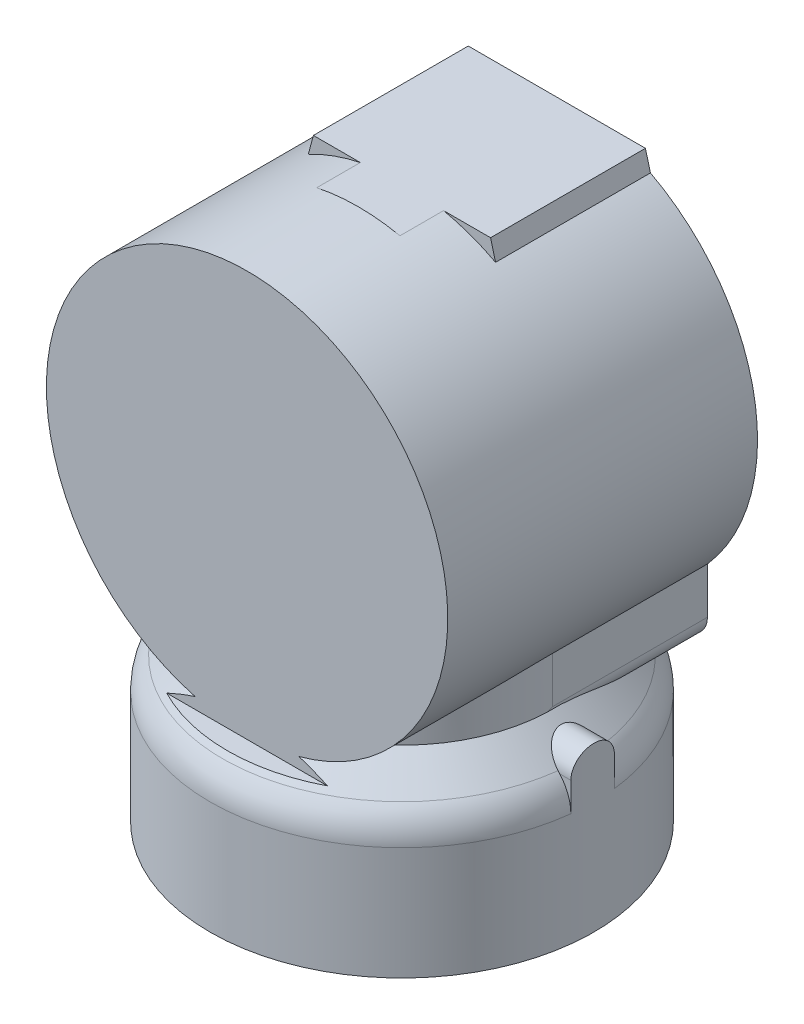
ISO-10303-21;
HEADER;
FILE_DESCRIPTION(('STEP AP214'),'2;1');
FILE_NAME('part.step','',(''),(''),'','','');
FILE_SCHEMA(('AUTOMOTIVE_DESIGN { 1 0 10303 214 1 1 1 1 }'));
ENDSEC;
DATA;
#1=APPLICATION_CONTEXT('core data for automotive mechanical design processes');
#2=APPLICATION_PROTOCOL_DEFINITION('international standard','automotive_design',2000,#1);
#3=PRODUCT_CONTEXT('',#1,'mechanical');
#4=PRODUCT('Part','Part','',(#3));
#5=PRODUCT_RELATED_PRODUCT_CATEGORY('part','',(#4));
#6=PRODUCT_DEFINITION_FORMATION('','',#4);
#7=PRODUCT_DEFINITION_CONTEXT('part definition',#1,'design');
#8=PRODUCT_DEFINITION('design','',#6,#7);
#9=PRODUCT_DEFINITION_SHAPE('','',#8);
#10=(LENGTH_UNIT() NAMED_UNIT(*) SI_UNIT(.MILLI.,.METRE.));
#11=(NAMED_UNIT(*) PLANE_ANGLE_UNIT() SI_UNIT($,.RADIAN.));
#12=(NAMED_UNIT(*) SI_UNIT($,.STERADIAN.) SOLID_ANGLE_UNIT());
#13=UNCERTAINTY_MEASURE_WITH_UNIT(LENGTH_MEASURE(1.E-05),#10,'distance_accuracy_value','');
#14=(GEOMETRIC_REPRESENTATION_CONTEXT(3) GLOBAL_UNCERTAINTY_ASSIGNED_CONTEXT((#13)) GLOBAL_UNIT_ASSIGNED_CONTEXT((#10,
#11,#12)) REPRESENTATION_CONTEXT('',''));
#15=CARTESIAN_POINT('',(0.,0.,0.));
#16=DIRECTION('',(0.,0.,1.));
#17=DIRECTION('',(1.,0.,0.));
#18=AXIS2_PLACEMENT_3D('',#15,#16,#17);
#19=CARTESIAN_POINT('',(-63.2899971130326,48.0000000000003,10.0000000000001));
#20=DIRECTION('',(0.,0.,-1.));
#21=DIRECTION('',(-1.,0.,0.));
#22=AXIS2_PLACEMENT_3D('',#19,#20,#21);
#23=PLANE('',#22);
#24=CARTESIAN_POINT('',(2.24557012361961E-13,2.28983498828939E-13,10.0000000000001));
#25=DIRECTION('',(0.,0.,1.));
#26=DIRECTION('',(1.,0.,0.));
#27=AXIS2_PLACEMENT_3D('',#24,#25,#26);
#28=CIRCLE('',#27,46.);
#29=CARTESIAN_POINT('',(9.53939201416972,45.0000000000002,10.0000000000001));
#30=VERTEX_POINT('',#29);
#31=CARTESIAN_POINT('',(-9.53939201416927,45.0000000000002,10.0000000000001));
#32=VERTEX_POINT('',#31);
#33=EDGE_CURVE('E450',#30,#32,#28,.T.);
#34=ORIENTED_EDGE('',*,*,#33,.F.);
#35=DIRECTION('',(1.,0.,0.));
#36=VECTOR('',#35,1.);
#37=CARTESIAN_POINT('',(-3.27697298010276,45.0000000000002,10.0000000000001));
#38=LINE('',#37,#36);
#39=EDGE_CURVE('E444',#32,#30,#38,.T.);
#40=ORIENTED_EDGE('',*,*,#39,.F.);
#41=EDGE_LOOP('',(#34,#40));
#42=FACE_BOUND('',#41,.T.);
#43=ADVANCED_FACE('F16',(#42),#23,.T.);
#44=CARTESIAN_POINT('',(-3.27697298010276,45.0000000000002,-20.336816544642));
#45=DIRECTION('',(0.,1.,0.));
#46=DIRECTION('',(0.,0.,1.));
#47=AXIS2_PLACEMENT_3D('',#44,#45,#46);
#48=PLANE('',#47);
#49=DIRECTION('',(0.,0.,1.));
#50=VECTOR('',#49,1.);
#51=CARTESIAN_POINT('',(-9.53939201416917,45.0000000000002,0.));
#52=LINE('',#51,#50);
#53=CARTESIAN_POINT('',(-9.53939201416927,45.0000000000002,0.));
#54=VERTEX_POINT('',#53);
#55=EDGE_CURVE('E447',#32,#54,#52,.F.);
#56=ORIENTED_EDGE('',*,*,#55,.F.);
#57=ORIENTED_EDGE('',*,*,#39,.T.);
#58=DIRECTION('',(0.,0.,1.));
#59=VECTOR('',#58,1.);
#60=CARTESIAN_POINT('',(9.53939201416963,45.0000000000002,0.));
#61=LINE('',#60,#59);
#62=CARTESIAN_POINT('',(9.53939201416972,45.0000000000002,0.));
#63=VERTEX_POINT('',#62);
#64=EDGE_CURVE('E630',#63,#30,#61,.T.);
#65=ORIENTED_EDGE('',*,*,#64,.F.);
#66=DIRECTION('',(1.,0.,0.));
#67=VECTOR('',#66,1.);
#68=CARTESIAN_POINT('',(2.273737E-13,45.0000000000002,0.));
#69=LINE('',#68,#67);
#70=CARTESIAN_POINT('',(20.3038475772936,45.0000000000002,0.));
#71=VERTEX_POINT('',#70);
#72=EDGE_CURVE('E472',#71,#63,#69,.F.);
#73=ORIENTED_EDGE('',*,*,#72,.F.);
#74=DIRECTION('',(0.,0.,1.));
#75=VECTOR('',#74,1.);
#76=CARTESIAN_POINT('',(20.3038475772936,45.0000000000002,-38.4999999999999));
#77=LINE('',#76,#75);
#78=CARTESIAN_POINT('',(20.3038475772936,45.0000000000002,-35.4999999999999));
#79=VERTEX_POINT('',#78);
#80=EDGE_CURVE('E185',#79,#71,#77,.T.);
#81=ORIENTED_EDGE('',*,*,#80,.F.);
#82=DIRECTION('',(-1.,0.,0.));
#83=VECTOR('',#82,1.);
#84=CARTESIAN_POINT('',(1.5928611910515,45.0000000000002,-35.4999999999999));
#85=LINE('',#84,#83);
#86=CARTESIAN_POINT('',(-20.3038475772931,45.0000000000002,-35.4999999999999));
#87=VERTEX_POINT('',#86);
#88=EDGE_CURVE('E464',#87,#79,#85,.F.);
#89=ORIENTED_EDGE('',*,*,#88,.F.);
#90=DIRECTION('',(0.,0.,1.));
#91=VECTOR('',#90,1.);
#92=CARTESIAN_POINT('',(-20.3038475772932,45.0000000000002,-38.4999999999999));
#93=LINE('',#92,#91);
#94=CARTESIAN_POINT('',(-20.3038475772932,45.0000000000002,0.));
#95=VERTEX_POINT('',#94);
#96=EDGE_CURVE('E438',#95,#87,#93,.F.);
#97=ORIENTED_EDGE('',*,*,#96,.F.);
#98=DIRECTION('',(1.,0.,0.));
#99=VECTOR('',#98,1.);
#100=CARTESIAN_POINT('',(2.273737E-13,45.0000000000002,0.));
#101=LINE('',#100,#99);
#102=EDGE_CURVE('E441',#54,#95,#101,.F.);
#103=ORIENTED_EDGE('',*,*,#102,.F.);
#104=EDGE_LOOP('',(#56,#57,#65,#73,#81,#89,#97,#103));
#105=FACE_BOUND('',#104,.T.);
#106=ADVANCED_FACE('F684',(#105),#48,.T.);
#107=CARTESIAN_POINT('',(2.273737E-13,45.5698781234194,0.));
#108=DIRECTION('',(0.,0.,1.));
#109=DIRECTION('',(1.,0.,0.));
#110=AXIS2_PLACEMENT_3D('',#107,#108,#109);
#111=PLANE('',#110);
#112=DIRECTION('',(-0.258819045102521,-0.965925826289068,0.));
#113=VECTOR('',#112,1.);
#114=CARTESIAN_POINT('',(-21.459292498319,40.6878208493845,0.));
#115=LINE('',#114,#113);
#116=CARTESIAN_POINT('',(-21.459292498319,40.6878208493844,0.));
#117=VERTEX_POINT('',#116);
#118=EDGE_CURVE('E435',#117,#95,#115,.F.);
#119=ORIENTED_EDGE('',*,*,#118,.F.);
#120=CARTESIAN_POINT('',(2.24557012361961E-13,2.28983498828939E-13,0.));
#121=DIRECTION('',(0.,0.,1.));
#122=DIRECTION('',(1.,0.,0.));
#123=AXIS2_PLACEMENT_3D('',#120,#121,#122);
#124=CIRCLE('',#123,46.);
#125=EDGE_CURVE('E434',#54,#117,#124,.T.);
#126=ORIENTED_EDGE('',*,*,#125,.F.);
#127=ORIENTED_EDGE('',*,*,#102,.T.);
#128=EDGE_LOOP('',(#119,#126,#127));
#129=FACE_BOUND('',#128,.T.);
#130=ADVANCED_FACE('F678',(#129),#111,.T.);
#131=CARTESIAN_POINT('',(-21.459292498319,40.6878208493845,-38.4999999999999));
#132=DIRECTION('',(-0.965925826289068,0.258819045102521,0.));
#133=DIRECTION('',(-0.258819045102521,-0.965925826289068,0.));
#134=AXIS2_PLACEMENT_3D('',#131,#132,#133);
#135=PLANE('',#134);
#136=DIRECTION('',(0.,0.,1.));
#137=VECTOR('',#136,1.);
#138=CARTESIAN_POINT('',(-21.459292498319,40.6878208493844,0.));
#139=LINE('',#138,#137);
#140=CARTESIAN_POINT('',(-21.4592924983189,40.6878208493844,-35.4999999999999));
#141=VERTEX_POINT('',#140);
#142=EDGE_CURVE('E427',#117,#141,#139,.F.);
#143=ORIENTED_EDGE('',*,*,#142,.F.);
#144=ORIENTED_EDGE('',*,*,#118,.T.);
#145=ORIENTED_EDGE('',*,*,#96,.T.);
#146=DIRECTION('',(0.258819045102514,0.96592582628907,0.));
#147=VECTOR('',#146,1.);
#148=CARTESIAN_POINT('',(-21.4592924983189,40.6878208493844,-35.4999999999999));
#149=LINE('',#148,#147);
#150=EDGE_CURVE('E598',#141,#87,#149,.T.);
#151=ORIENTED_EDGE('',*,*,#150,.F.);
#152=EDGE_LOOP('',(#143,#144,#145,#151));
#153=FACE_BOUND('',#152,.T.);
#154=ADVANCED_FACE('F669',(#153),#135,.T.);
#155=CARTESIAN_POINT('',(-34.4999999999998,-45.9999999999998,-38.4999999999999));
#156=DIRECTION('',(-1.,0.,0.));
#157=DIRECTION('',(0.,0.,1.));
#158=AXIS2_PLACEMENT_3D('',#155,#156,#157);
#159=PLANE('',#158);
#160=DIRECTION('',(0.,-1.,0.));
#161=VECTOR('',#160,1.);
#162=CARTESIAN_POINT('',(-34.4999999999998,-30.7499999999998,1.03017415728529E-13));
#163=LINE('',#162,#161);
#164=CARTESIAN_POINT('',(-34.4999999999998,-30.4261400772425,1.03017415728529E-13));
#165=VERTEX_POINT('',#164);
#166=CARTESIAN_POINT('',(-34.4999999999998,-40.9999999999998,1.03550412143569E-13));
#167=VERTEX_POINT('',#166);
#168=EDGE_CURVE('E430',#165,#167,#163,.T.);
#169=ORIENTED_EDGE('',*,*,#168,.F.);
#170=DIRECTION('',(0.,0.,1.));
#171=VECTOR('',#170,1.);
#172=CARTESIAN_POINT('',(-34.4999999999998,-30.4261400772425,0.));
#173=LINE('',#172,#171);
#174=CARTESIAN_POINT('',(-34.4999999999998,-30.4261400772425,-35.4999999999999));
#175=VERTEX_POINT('',#174);
#176=EDGE_CURVE('E420',#175,#165,#173,.T.);
#177=ORIENTED_EDGE('',*,*,#176,.F.);
#178=DIRECTION('',(0.,1.,0.));
#179=VECTOR('',#178,1.);
#180=CARTESIAN_POINT('',(-34.4999999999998,8.40931105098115,-35.4999999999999));
#181=LINE('',#180,#179);
#182=CARTESIAN_POINT('',(-34.4999999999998,-40.9999999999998,-35.4999999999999));
#183=VERTEX_POINT('',#182);
#184=EDGE_CURVE('E176',#183,#175,#181,.T.);
#185=ORIENTED_EDGE('',*,*,#184,.F.);
#186=DIRECTION('',(0.,0.,1.));
#187=VECTOR('',#186,1.);
#188=CARTESIAN_POINT('',(-34.4999999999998,-40.9999999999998,-38.4999999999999));
#189=LINE('',#188,#187);
#190=EDGE_CURVE('E456',#167,#183,#189,.F.);
#191=ORIENTED_EDGE('',*,*,#190,.F.);
#192=EDGE_LOOP('',(#169,#177,#185,#191));
#193=FACE_BOUND('',#192,.T.);
#194=ADVANCED_FACE('F666',(#193),#159,.T.);
#195=CARTESIAN_POINT('',(34.5000000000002,2.18825E-13,-38.4999999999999));
#196=DIRECTION('',(1.,0.,0.));
#197=DIRECTION('',(0.,0.,-1.));
#198=AXIS2_PLACEMENT_3D('',#195,#196,#197);
#199=PLANE('',#198);
#200=DIRECTION('',(0.,-1.,0.));
#201=VECTOR('',#200,1.);
#202=CARTESIAN_POINT('',(34.5000000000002,-30.7499999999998,0.));
#203=LINE('',#202,#201);
#204=CARTESIAN_POINT('',(34.5000000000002,-40.9999999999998,0.));
#205=VERTEX_POINT('',#204);
#206=CARTESIAN_POINT('',(34.5000000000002,-30.4261400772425,0.));
#207=VERTEX_POINT('',#206);
#208=EDGE_CURVE('E633',#205,#207,#203,.F.);
#209=ORIENTED_EDGE('',*,*,#208,.F.);
#210=DIRECTION('',(0.,0.,1.));
#211=VECTOR('',#210,1.);
#212=CARTESIAN_POINT('',(34.5000000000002,-40.9999999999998,-38.4999999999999));
#213=LINE('',#212,#211);
#214=CARTESIAN_POINT('',(34.5000000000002,-40.9999999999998,-35.4999999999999));
#215=VERTEX_POINT('',#214);
#216=EDGE_CURVE('E452',#215,#205,#213,.T.);
#217=ORIENTED_EDGE('',*,*,#216,.F.);
#218=DIRECTION('',(0.,1.,0.));
#219=VECTOR('',#218,1.);
#220=CARTESIAN_POINT('',(34.5000000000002,8.40931105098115,-35.4999999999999));
#221=LINE('',#220,#219);
#222=CARTESIAN_POINT('',(34.5000000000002,-30.4261400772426,-35.4999999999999));
#223=VERTEX_POINT('',#222);
#224=EDGE_CURVE('E605',#223,#215,#221,.F.);
#225=ORIENTED_EDGE('',*,*,#224,.F.);
#226=DIRECTION('',(0.,0.,1.));
#227=VECTOR('',#226,1.);
#228=CARTESIAN_POINT('',(34.5000000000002,-30.4261400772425,0.));
#229=LINE('',#228,#227);
#230=EDGE_CURVE('E412',#207,#223,#229,.F.);
#231=ORIENTED_EDGE('',*,*,#230,.F.);
#232=EDGE_LOOP('',(#209,#217,#225,#231));
#233=FACE_BOUND('',#232,.T.);
#234=ADVANCED_FACE('F668',(#233),#199,.T.);
#235=CARTESIAN_POINT('',(19.5000000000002,48.0000000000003,-38.4999999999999));
#236=DIRECTION('',(0.965925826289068,0.258819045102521,0.));
#237=DIRECTION('',(-0.258819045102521,0.965925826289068,0.));
#238=AXIS2_PLACEMENT_3D('',#235,#236,#237);
#239=PLANE('',#238);
#240=DIRECTION('',(0.,0.,1.));
#241=VECTOR('',#240,1.);
#242=CARTESIAN_POINT('',(21.4592924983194,40.6878208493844,0.));
#243=LINE('',#242,#241);
#244=CARTESIAN_POINT('',(21.4592924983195,40.6878208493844,-35.4999999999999));
#245=VERTEX_POINT('',#244);
#246=CARTESIAN_POINT('',(21.4592924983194,40.6878208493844,0.));
#247=VERTEX_POINT('',#246);
#248=EDGE_CURVE('E627',#245,#247,#243,.T.);
#249=ORIENTED_EDGE('',*,*,#248,.F.);
#250=DIRECTION('',(0.258819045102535,-0.965925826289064,0.));
#251=VECTOR('',#250,1.);
#252=CARTESIAN_POINT('',(20.3038475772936,45.0000000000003,-35.4999999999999));
#253=LINE('',#252,#251);
#254=EDGE_CURVE('E467',#79,#245,#253,.T.);
#255=ORIENTED_EDGE('',*,*,#254,.F.);
#256=ORIENTED_EDGE('',*,*,#80,.T.);
#257=DIRECTION('',(-0.258819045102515,0.96592582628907,0.));
#258=VECTOR('',#257,1.);
#259=CARTESIAN_POINT('',(21.4592924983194,40.6878208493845,0.));
#260=LINE('',#259,#258);
#261=EDGE_CURVE('E468',#247,#71,#260,.T.);
#262=ORIENTED_EDGE('',*,*,#261,.F.);
#263=EDGE_LOOP('',(#249,#255,#256,#262));
#264=FACE_BOUND('',#263,.T.);
#265=ADVANCED_FACE('F675',(#264),#239,.T.);
#266=CARTESIAN_POINT('',(2.273737E-13,45.5698781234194,0.));
#267=DIRECTION('',(0.,0.,1.));
#268=DIRECTION('',(1.,0.,0.));
#269=AXIS2_PLACEMENT_3D('',#266,#267,#268);
#270=PLANE('',#269);
#271=CARTESIAN_POINT('',(2.24557012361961E-13,2.28983498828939E-13,0.));
#272=DIRECTION('',(0.,0.,1.));
#273=DIRECTION('',(1.,0.,0.));
#274=AXIS2_PLACEMENT_3D('',#271,#272,#273);
#275=CIRCLE('',#274,46.);
#276=EDGE_CURVE('E588',#247,#63,#275,.T.);
#277=ORIENTED_EDGE('',*,*,#276,.F.);
#278=ORIENTED_EDGE('',*,*,#261,.T.);
#279=ORIENTED_EDGE('',*,*,#72,.T.);
#280=EDGE_LOOP('',(#277,#278,#279));
#281=FACE_BOUND('',#280,.T.);
#282=ADVANCED_FACE('F699',(#281),#270,.T.);
#283=CARTESIAN_POINT('',(1.5928611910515,8.40931105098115,-35.4999999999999));
#284=DIRECTION('',(0.,0.,-1.));
#285=DIRECTION('',(-1.,0.,0.));
#286=AXIS2_PLACEMENT_3D('',#283,#284,#285);
#287=PLANE('',#286);
#288=CARTESIAN_POINT('',(2.24557012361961E-13,2.28983498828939E-13,-35.4999999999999));
#289=DIRECTION('',(0.,0.,1.));
#290=DIRECTION('',(1.,0.,0.));
#291=AXIS2_PLACEMENT_3D('',#288,#289,#290);
#292=CIRCLE('',#291,46.);
#293=EDGE_CURVE('E424',#141,#175,#292,.T.);
#294=ORIENTED_EDGE('',*,*,#293,.F.);
#295=ORIENTED_EDGE('',*,*,#150,.T.);
#296=ORIENTED_EDGE('',*,*,#88,.T.);
#297=ORIENTED_EDGE('',*,*,#254,.T.);
#298=CARTESIAN_POINT('',(2.24557012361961E-13,2.28983498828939E-13,-35.4999999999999));
#299=DIRECTION('',(0.,0.,1.));
#300=DIRECTION('',(1.,0.,0.));
#301=AXIS2_PLACEMENT_3D('',#298,#299,#300);
#302=CIRCLE('',#301,46.);
#303=EDGE_CURVE('E414',#223,#245,#302,.T.);
#304=ORIENTED_EDGE('',*,*,#303,.F.);
#305=ORIENTED_EDGE('',*,*,#224,.T.);
#306=CARTESIAN_POINT('',(29.5000000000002,-40.9999999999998,-35.4999999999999));
#307=DIRECTION('',(0.,0.,1.));
#308=DIRECTION('',(1.,0.,0.));
#309=AXIS2_PLACEMENT_3D('',#306,#307,#308);
#310=CIRCLE('',#309,5.);
#311=CARTESIAN_POINT('',(29.5000000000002,-45.9999999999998,-35.4999999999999));
#312=VERTEX_POINT('',#311);
#313=EDGE_CURVE('E455',#312,#215,#310,.T.);
#314=ORIENTED_EDGE('',*,*,#313,.F.);
#315=DIRECTION('',(1.,0.,0.));
#316=VECTOR('',#315,1.);
#317=CARTESIAN_POINT('',(34.5000000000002,-45.9999999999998,-35.4999999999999));
#318=LINE('',#317,#316);
#319=CARTESIAN_POINT('',(20.0000000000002,-45.9999999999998,-35.4999999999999));
#320=VERTEX_POINT('',#319);
#321=EDGE_CURVE('E579',#320,#312,#318,.T.);
#322=ORIENTED_EDGE('',*,*,#321,.F.);
#323=DIRECTION('',(0.,1.,0.));
#324=VECTOR('',#323,1.);
#325=CARTESIAN_POINT('',(20.0000000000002,8.40931105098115,-35.4999999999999));
#326=LINE('',#325,#324);
#327=CARTESIAN_POINT('',(20.0000000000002,-46.9999999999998,-35.4999999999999));
#328=VERTEX_POINT('',#327);
#329=EDGE_CURVE('E607',#320,#328,#326,.F.);
#330=ORIENTED_EDGE('',*,*,#329,.T.);
#331=DIRECTION('',(1.,0.,0.));
#332=VECTOR('',#331,1.);
#333=CARTESIAN_POINT('',(-91.7835570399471,-46.9999999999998,-35.4999999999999));
#334=LINE('',#333,#332);
#335=CARTESIAN_POINT('',(-19.9999999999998,-46.9999999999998,-35.4999999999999));
#336=VERTEX_POINT('',#335);
#337=EDGE_CURVE('E576',#336,#328,#334,.T.);
#338=ORIENTED_EDGE('',*,*,#337,.F.);
#339=DIRECTION('',(0.,1.,0.));
#340=VECTOR('',#339,1.);
#341=CARTESIAN_POINT('',(-19.9999999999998,8.40931105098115,-35.4999999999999));
#342=LINE('',#341,#340);
#343=CARTESIAN_POINT('',(-19.9999999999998,-45.9999999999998,-35.4999999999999));
#344=VERTEX_POINT('',#343);
#345=EDGE_CURVE('E604',#336,#344,#342,.T.);
#346=ORIENTED_EDGE('',*,*,#345,.T.);
#347=DIRECTION('',(1.,0.,0.));
#348=VECTOR('',#347,1.);
#349=CARTESIAN_POINT('',(34.5000000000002,-45.9999999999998,-35.4999999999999));
#350=LINE('',#349,#348);
#351=CARTESIAN_POINT('',(-29.4999999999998,-45.9999999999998,-35.4999999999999));
#352=VERTEX_POINT('',#351);
#353=EDGE_CURVE('E585',#352,#344,#350,.T.);
#354=ORIENTED_EDGE('',*,*,#353,.F.);
#355=CARTESIAN_POINT('',(-29.4999999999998,-40.9999999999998,-35.4999999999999));
#356=DIRECTION('',(0.,0.,1.));
#357=DIRECTION('',(1.,0.,0.));
#358=AXIS2_PLACEMENT_3D('',#355,#356,#357);
#359=CIRCLE('',#358,5.);
#360=EDGE_CURVE('E19',#183,#352,#359,.T.);
#361=ORIENTED_EDGE('',*,*,#360,.F.);
#362=ORIENTED_EDGE('',*,*,#184,.T.);
#363=EDGE_LOOP('',(#294,#295,#296,#297,#304,#305,#314,#322,#330,#338,#346,#354,#361,#362));
#364=FACE_BOUND('',#363,.T.);
#365=ADVANCED_FACE('F706',(#364),#287,.T.);
#366=CARTESIAN_POINT('',(81.3517709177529,-46.9999999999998,35.5000000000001));
#367=DIRECTION('',(0.,1.,0.));
#368=DIRECTION('',(0.,0.,1.));
#369=AXIS2_PLACEMENT_3D('',#366,#367,#368);
#370=PLANE('',#369);
#371=CARTESIAN_POINT('',(2.273737E-13,-47.0000000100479,1.07552855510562E-13));
#372=DIRECTION('',(0.,-1.,0.));
#373=DIRECTION('',(0.,0.,-1.));
#374=AXIS2_PLACEMENT_3D('',#371,#372,#373);
#375=CIRCLE('',#374,39.9999999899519);
#376=CARTESIAN_POINT('',(18.4323085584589,-47.0000000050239,35.5000000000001));
#377=VERTEX_POINT('',#376);
#378=CARTESIAN_POINT('',(-18.4323085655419,-47.000000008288,35.5000000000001));
#379=VERTEX_POINT('',#378);
#380=EDGE_CURVE('E727',#377,#379,#375,.T.);
#381=ORIENTED_EDGE('',*,*,#380,.F.);
#382=DIRECTION('',(1.,0.,0.));
#383=VECTOR('',#382,1.);
#384=CARTESIAN_POINT('',(5.84230592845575,-46.9999999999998,35.5000000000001));
#385=LINE('',#384,#383);
#386=EDGE_CURVE('E596',#379,#377,#385,.T.);
#387=ORIENTED_EDGE('',*,*,#386,.F.);
#388=EDGE_LOOP('',(#381,#387));
#389=FACE_BOUND('',#388,.T.);
#390=ADVANCED_FACE('F737',(#389),#370,.T.);
#391=CARTESIAN_POINT('',(5.84230592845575,5.41897494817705,35.5000000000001));
#392=DIRECTION('',(0.,0.,1.));
#393=DIRECTION('',(1.,0.,0.));
#394=AXIS2_PLACEMENT_3D('',#391,#392,#393);
#395=PLANE('',#394);
#396=CARTESIAN_POINT('',(-18.4323085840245,-47.0000000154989,35.5000000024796));
#397=CARTESIAN_POINT('',(-17.8998028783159,-46.7546331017,35.5000000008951));
#398=CARTESIAN_POINT('',(-17.3640867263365,-46.5161310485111,35.500000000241));
#399=CARTESIAN_POINT('',(-16.286621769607,-46.0546662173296,35.4999999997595));
#400=CARTESIAN_POINT('',(-15.7448792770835,-45.8316886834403,35.4999999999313));
#401=CARTESIAN_POINT('',(-14.6546663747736,-45.4025807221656,35.5000000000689));
#402=CARTESIAN_POINT('',(-14.1061952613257,-45.1964520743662,35.5000000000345));
#403=CARTESIAN_POINT('',(-13.0020899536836,-44.8026210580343,35.4999999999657));
#404=CARTESIAN_POINT('',(-12.4464493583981,-44.6149366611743,35.4999999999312));
#405=CARTESIAN_POINT('',(-11.88750768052,-44.4374523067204,35.5000000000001));
#406=B_SPLINE_CURVE_WITH_KNOTS('',3,(#396,#397,#398,#399,#400,#401,#402,#403,#404,#405),
.UNSPECIFIED.,.F.,.F.,(4,2,2,2,4),(0.,1.75896312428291,3.51623087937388,5.27368399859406,
7.03283290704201),.UNSPECIFIED.);
#407=CARTESIAN_POINT('',(-11.8875075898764,-44.4374522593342,35.4999999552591));
#408=VERTEX_POINT('',#407);
#409=EDGE_CURVE('E338',#379,#408,#406,.T.);
#410=ORIENTED_EDGE('',*,*,#409,.F.);
#411=ORIENTED_EDGE('',*,*,#386,.T.);
#412=CARTESIAN_POINT('',(11.8875076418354,-44.4374523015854,35.4999999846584));
#413=CARTESIAN_POINT('',(12.4464493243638,-44.6149366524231,35.4999999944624));
#414=CARTESIAN_POINT('',(13.0020899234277,-44.8026210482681,35.4999999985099));
#415=CARTESIAN_POINT('',(14.1061952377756,-45.1964520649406,35.5000000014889));
#416=CARTESIAN_POINT('',(14.6546663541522,-45.4025807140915,35.5000000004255));
#417=CARTESIAN_POINT('',(15.7448792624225,-45.8316886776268,35.4999999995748));
#418=CARTESIAN_POINT('',(16.2866217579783,-46.0546662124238,35.4999999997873));
#419=CARTESIAN_POINT('',(17.3640867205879,-46.5161310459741,35.5000000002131));
#420=CARTESIAN_POINT('',(17.8998028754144,-46.7546331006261,35.5000000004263));
#421=CARTESIAN_POINT('',(18.4323085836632,-47.0000000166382,35.5000000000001));
#422=B_SPLINE_CURVE_WITH_KNOTS('',3,(#412,#413,#414,#415,#416,#417,#418,#419,#420,#421),
.UNSPECIFIED.,.F.,.F.,(4,2,2,2,4),(0.,1.75914891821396,3.51660204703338,5.27386981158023,
7.03283294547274),.UNSPECIFIED.);
#423=CARTESIAN_POINT('',(11.8875077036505,-44.4374522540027,35.5000000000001));
#424=VERTEX_POINT('',#423);
#425=EDGE_CURVE('E716',#424,#377,#422,.T.);
#426=ORIENTED_EDGE('',*,*,#425,.F.);
#427=CARTESIAN_POINT('',(2.24557012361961E-13,2.28983498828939E-13,35.5000000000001));
#428=DIRECTION('',(0.,0.,1.));
#429=DIRECTION('',(1.,0.,0.));
#430=AXIS2_PLACEMENT_3D('',#427,#428,#429);
#431=CIRCLE('',#430,46.);
#432=EDGE_CURVE('E413',#408,#424,#431,.F.);
#433=ORIENTED_EDGE('',*,*,#432,.F.);
#434=EDGE_LOOP('',(#410,#411,#426,#433));
#435=FACE_BOUND('',#434,.T.);
#436=ADVANCED_FACE('F733',(#435),#395,.T.);
#437=CARTESIAN_POINT('',(2.25261184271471E-13,-30.3596969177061,1.04083408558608E-13));
#438=DIRECTION('',(0.,-1.,0.));
#439=DIRECTION('',(0.,0.,-1.));
#440=AXIS2_PLACEMENT_3D('',#437,#438,#439);
#441=CYLINDRICAL_SURFACE('',#440,34.5);
#442=CARTESIAN_POINT('',(-34.4999999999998,-30.4261400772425,1.04692119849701E-13));
#443=CARTESIAN_POINT('',(-34.5000183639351,-30.4260951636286,0.406621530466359));
#444=CARTESIAN_POINT('',(-34.4928117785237,-30.4342901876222,0.813224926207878));
#445=CARTESIAN_POINT('',(-34.4640879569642,-30.4668262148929,1.62521289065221));
#446=CARTESIAN_POINT('',(-34.4425731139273,-30.4911645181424,2.03059765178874));
#447=CARTESIAN_POINT('',(-34.3854302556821,-30.5555876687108,2.83827825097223));
#448=CARTESIAN_POINT('',(-34.3498311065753,-30.5956403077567,3.24057870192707));
#449=CARTESIAN_POINT('',(-34.2647861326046,-30.6908533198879,4.04188661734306));
#450=CARTESIAN_POINT('',(-34.2153398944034,-30.7460141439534,4.44089398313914));
#451=CARTESIAN_POINT('',(-34.0482145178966,-30.9313248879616,5.62084514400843));
#452=CARTESIAN_POINT('',(-33.9109394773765,-31.0822370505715,6.39590772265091));
#453=CARTESIAN_POINT('',(-33.586667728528,-31.4323454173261,7.92446316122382));
#454=CARTESIAN_POINT('',(-33.3996473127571,-31.6315646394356,8.67794554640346));
#455=CARTESIAN_POINT('',(-32.9808303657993,-32.0679815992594,10.1537358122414));
#456=CARTESIAN_POINT('',(-32.7494130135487,-32.3048550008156,10.8762484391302));
#457=CARTESIAN_POINT('',(-32.2437139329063,-32.8096092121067,12.2947129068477));
#458=CARTESIAN_POINT('',(-31.9694361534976,-33.077487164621,12.9906671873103));
#459=CARTESIAN_POINT('',(-31.3790858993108,-33.6380639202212,14.3582772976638));
#460=CARTESIAN_POINT('',(-31.0628367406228,-33.9308656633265,15.0298142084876));
#461=CARTESIAN_POINT('',(-30.3913127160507,-34.533632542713,16.3451362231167));
#462=CARTESIAN_POINT('',(-30.0360318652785,-34.8436003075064,16.9889170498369));
#463=CARTESIAN_POINT('',(-29.2097218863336,-35.540709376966,18.3800538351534));
#464=CARTESIAN_POINT('',(-28.7300148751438,-35.9304490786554,19.1209639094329));
#465=CARTESIAN_POINT('',(-27.7173405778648,-36.717304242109,20.5614763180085));
#466=CARTESIAN_POINT('',(-27.1843625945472,-37.1144211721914,21.2610703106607));
#467=CARTESIAN_POINT('',(-26.0676333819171,-37.9070752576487,22.6163148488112));
#468=CARTESIAN_POINT('',(-25.4839969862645,-38.3026139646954,23.2720591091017));
#469=CARTESIAN_POINT('',(-24.2660396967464,-39.0855883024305,24.5393814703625));
#470=CARTESIAN_POINT('',(-23.631739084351,-39.4730270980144,25.1509770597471));
#471=CARTESIAN_POINT('',(-22.4785378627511,-40.1377682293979,26.1802163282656));
#472=CARTESIAN_POINT('',(-21.9705726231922,-40.4183310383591,26.6080446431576));
#473=CARTESIAN_POINT('',(-20.9272962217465,-40.9682332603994,27.436130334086));
#474=CARTESIAN_POINT('',(-20.3919971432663,-41.2375775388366,27.8363997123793));
#475=CARTESIAN_POINT('',(-19.8431351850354,-41.4999998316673,28.2223313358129));
#476=B_SPLINE_CURVE_WITH_KNOTS('',3,(#442,#443,#444,#445,#446,#447,#448,#449,#450,#451,#452,
#453,#454,#455,#456,#457,#458,#459,#460,#461,#462,#463,#464,#465,#466,#467,#468,#469,#470,#471,
#472,#473,#474,#475),.UNSPECIFIED.,.F.,.F.,(4,2,2,2,2,2,2,2,2,2,2,2,2,2,2,2,4),(0.,
1.21968778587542,2.43917162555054,3.65616894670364,4.87320259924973,7.27364917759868,
9.67524180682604,12.0571695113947,14.4388778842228,16.8309507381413,19.2233908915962,
22.1154474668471,25.0080859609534,27.8943305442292,30.7794254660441,32.9412264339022,
35.1020798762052),.UNSPECIFIED.);
#477=CARTESIAN_POINT('',(-19.843135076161,-41.4999998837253,28.2223314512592));
#478=VERTEX_POINT('',#477);
#479=EDGE_CURVE('E397',#165,#478,#476,.T.);
#480=ORIENTED_EDGE('',*,*,#479,.F.);
#481=ORIENTED_EDGE('',*,*,#168,.T.);
#482=CARTESIAN_POINT('',(-34.4749371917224,-41.4999999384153,1.31480250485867));
#483=CARTESIAN_POINT('',(-34.4912046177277,-41.3379173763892,0.888119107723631));
#484=CARTESIAN_POINT('',(-34.4995530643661,-41.1756563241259,0.461424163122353));
#485=CARTESIAN_POINT('',(-34.4999941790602,-41.0088113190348,0.0231451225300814));
#486=CARTESIAN_POINT('',(-34.5000000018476,-41.0044057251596,0.0115725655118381));
#487=CARTESIAN_POINT('',(-34.4999999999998,-40.9999999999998,1.04083408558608E-13));
#488=B_SPLINE_CURVE_WITH_KNOTS('',3,(#482,#483,#484,#485,#486,#487),.UNSPECIFIED.,.F.,.F.,(4,2,
4),(0.,1.36974533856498,1.40689369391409),.UNSPECIFIED.);
#489=CARTESIAN_POINT('',(-34.4749371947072,-41.4999999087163,1.31480250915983));
#490=VERTEX_POINT('',#489);
#491=EDGE_CURVE('E459',#490,#167,#488,.T.);
#492=ORIENTED_EDGE('',*,*,#491,.F.);
#493=CARTESIAN_POINT('',(2.273737E-13,-41.4999999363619,1.062447E-13));
#494=DIRECTION('',(0.,-1.,0.));
#495=DIRECTION('',(0.,0.,1.));
#496=AXIS2_PLACEMENT_3D('',#493,#494,#495);
#497=CIRCLE('',#496,34.5000000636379);
#498=EDGE_CURVE('E384',#478,#490,#497,.T.);
#499=ORIENTED_EDGE('',*,*,#498,.F.);
#500=EDGE_LOOP('',(#480,#481,#492,#499));
#501=FACE_BOUND('',#500,.T.);
#502=ADVANCED_FACE('F655',(#501),#441,.T.);
#503=CARTESIAN_POINT('',(-29.4999999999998,-40.9999999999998,-35.4999999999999));
#504=DIRECTION('',(0.,0.,1.));
#505=DIRECTION('',(1.,0.,0.));
#506=AXIS2_PLACEMENT_3D('',#503,#504,#505);
#507=CYLINDRICAL_SURFACE('',#506,5.);
#508=ORIENTED_EDGE('',*,*,#491,.T.);
#509=ORIENTED_EDGE('',*,*,#190,.T.);
#510=ORIENTED_EDGE('',*,*,#360,.T.);
#511=DIRECTION('',(0.,0.,-1.));
#512=VECTOR('',#511,1.);
#513=CARTESIAN_POINT('',(-29.4999999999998,-45.9999999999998,-38.4999999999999));
#514=LINE('',#513,#512);
#515=CARTESIAN_POINT('',(-29.4999999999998,-45.9999999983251,-25.5098020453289));
#516=VERTEX_POINT('',#515);
#517=EDGE_CURVE('E580',#516,#352,#514,.T.);
#518=ORIENTED_EDGE('',*,*,#517,.F.);
#519=CARTESIAN_POINT('',(-34.4749372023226,-41.4999998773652,1.31480251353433));
#520=CARTESIAN_POINT('',(-34.475667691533,-41.4927027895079,1.1041966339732));
#521=CARTESIAN_POINT('',(-34.4762131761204,-41.4871466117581,0.89353334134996));
#522=CARTESIAN_POINT('',(-34.476952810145,-41.4795419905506,0.472143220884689));
#523=CARTESIAN_POINT('',(-34.4771469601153,-41.4774935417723,0.261416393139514));
#524=CARTESIAN_POINT('',(-34.4772304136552,-41.4766487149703,-0.370723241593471));
#525=CARTESIAN_POINT('',(-34.4766209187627,-41.4831507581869,-0.792155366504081));
#526=CARTESIAN_POINT('',(-34.4739321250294,-41.5100733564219,-1.63400292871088));
#527=CARTESIAN_POINT('',(-34.4718547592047,-41.530475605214,-2.0544189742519));
#528=CARTESIAN_POINT('',(-34.4657850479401,-41.5845647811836,-2.89438494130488));
#529=CARTESIAN_POINT('',(-34.4617926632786,-41.6182519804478,-3.31393484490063));
#530=CARTESIAN_POINT('',(-34.4512093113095,-41.697951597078,-4.15160407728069));
#531=CARTESIAN_POINT('',(-34.4446196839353,-41.7439576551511,-4.56972403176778));
#532=CARTESIAN_POINT('',(-34.4279888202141,-41.8471430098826,-5.40449888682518));
#533=CARTESIAN_POINT('',(-34.4179475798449,-41.9043223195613,-5.82115378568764));
#534=CARTESIAN_POINT('',(-34.3812211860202,-42.0907495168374,-7.06891525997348));
#535=CARTESIAN_POINT('',(-34.3479348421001,-42.2348684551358,-7.89763820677));
#536=CARTESIAN_POINT('',(-34.2506512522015,-42.5700330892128,-9.64021873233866));
#537=CARTESIAN_POINT('',(-34.1836365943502,-42.7645238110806,-10.5532360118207));
#538=CARTESIAN_POINT('',(-34.0071360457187,-43.1762500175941,-12.3704087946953));
#539=CARTESIAN_POINT('',(-33.8976385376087,-43.3934917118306,-13.2745618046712));
#540=CARTESIAN_POINT('',(-33.6929607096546,-43.7269193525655,-14.6234606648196));
#541=CARTESIAN_POINT('',(-33.6179217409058,-43.8394135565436,-15.0722193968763));
#542=CARTESIAN_POINT('',(-33.4527433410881,-44.0651918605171,-15.9667336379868));
#543=CARTESIAN_POINT('',(-33.3626053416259,-44.178475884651,-16.4124894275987));
#544=CARTESIAN_POINT('',(-33.1654830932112,-44.4039161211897,-17.3002182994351));
#545=CARTESIAN_POINT('',(-33.0585108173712,-44.5160730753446,-17.7421938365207));
#546=CARTESIAN_POINT('',(-32.8255423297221,-44.737189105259,-18.6218684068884));
#547=CARTESIAN_POINT('',(-32.6995498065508,-44.8461487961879,-19.0595682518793));
#548=CARTESIAN_POINT('',(-32.4404166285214,-45.0469591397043,-19.8833494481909));
#549=CARTESIAN_POINT('',(-32.3094596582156,-45.1393972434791,-20.2699717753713));
#550=CARTESIAN_POINT('',(-32.0277485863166,-45.3172101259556,-21.0378538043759));
#551=CARTESIAN_POINT('',(-31.8769882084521,-45.4025826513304,-21.419111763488));
#552=CARTESIAN_POINT('',(-31.634272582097,-45.5224890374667,-21.9839709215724));
#553=CARTESIAN_POINT('',(-31.5509234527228,-45.5609791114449,-22.1704489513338));
#554=CARTESIAN_POINT('',(-31.3781047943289,-45.634820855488,-22.5411708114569));
#555=CARTESIAN_POINT('',(-31.2886358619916,-45.6701728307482,-22.7254148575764));
#556=CARTESIAN_POINT('',(-31.1030956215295,-45.7370668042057,-23.0910952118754));
#557=CARTESIAN_POINT('',(-31.0070289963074,-45.7686114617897,-23.272533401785));
#558=CARTESIAN_POINT('',(-30.8076015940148,-45.8271091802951,-23.632128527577));
#559=CARTESIAN_POINT('',(-30.7042411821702,-45.8540624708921,-23.8102856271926));
#560=CARTESIAN_POINT('',(-30.5159175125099,-45.8964058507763,-24.1191420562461));
#561=CARTESIAN_POINT('',(-30.4326867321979,-45.9130092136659,-24.2507306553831));
#562=CARTESIAN_POINT('',(-30.2613029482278,-45.9424663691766,-24.5110853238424));
#563=CARTESIAN_POINT('',(-30.1731504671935,-45.9553205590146,-24.6398516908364));
#564=CARTESIAN_POINT('',(-29.9910065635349,-45.9766852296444,-24.8946992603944));
#565=CARTESIAN_POINT('',(-29.8969849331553,-45.9851707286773,-25.0207611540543));
#566=CARTESIAN_POINT('',(-29.703024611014,-45.9968124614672,-25.2686867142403));
#567=CARTESIAN_POINT('',(-29.603080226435,-45.9999634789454,-25.3905461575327));
#568=CARTESIAN_POINT('',(-29.5000000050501,-45.9999999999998,-25.509802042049));
#569=B_SPLINE_CURVE_WITH_KNOTS('',3,(#519,#520,#521,#522,#523,#524,#525,#526,#527,#528,#529,
#530,#531,#532,#533,#534,#535,#536,#537,#538,#539,#540,#541,#542,#543,#544,#545,#546,#547,#548,
#549,#550,#551,#552,#553,#554,#555,#556,#557,#558,#559,#560,#561,#562,#563,#564,#565,#566,#567,
#568),.UNSPECIFIED.,.F.,.F.,(4,2,2,2,2,2,2,2,2,2,2,2,2,2,2,2,2,2,2,2,2,2,2,2,4),(0.,
0.632185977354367,1.26437099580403,2.5285605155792,3.79108833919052,5.0536420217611,
6.31554519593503,7.57744984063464,10.101802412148,12.9083761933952,15.7157179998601,
17.1215862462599,18.5273212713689,19.9320609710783,21.3365285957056,22.5916946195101,
23.8472594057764,24.4707161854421,25.0941122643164,25.7170703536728,26.3399972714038,
26.8096224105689,27.2791977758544,27.7514293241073,28.2241223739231),.UNSPECIFIED.);
#570=EDGE_CURVE('E373',#490,#516,#569,.T.);
#571=ORIENTED_EDGE('',*,*,#570,.F.);
#572=EDGE_LOOP('',(#508,#509,#510,#518,#571));
#573=FACE_BOUND('',#572,.T.);
#574=ADVANCED_FACE('F650',(#573),#507,.T.);
#575=CARTESIAN_POINT('',(29.5000000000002,-40.9999999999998,-35.4999999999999));
#576=DIRECTION('',(0.,0.,1.));
#577=DIRECTION('',(1.,0.,0.));
#578=AXIS2_PLACEMENT_3D('',#575,#576,#577);
#579=CYLINDRICAL_SURFACE('',#578,5.);
#580=CARTESIAN_POINT('',(29.500000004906,-46.0000000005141,-25.5098020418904));
#581=CARTESIAN_POINT('',(29.5932624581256,-45.9999751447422,-25.4019163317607));
#582=CARTESIAN_POINT('',(29.6839571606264,-45.9973907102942,-25.2918858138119));
#583=CARTESIAN_POINT('',(29.8604780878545,-45.9877778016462,-25.0682843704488));
#584=CARTESIAN_POINT('',(29.9463075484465,-45.9807523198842,-24.9547158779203));
#585=CARTESIAN_POINT('',(30.1132390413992,-45.9629573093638,-24.7249855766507));
#586=CARTESIAN_POINT('',(30.1943544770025,-45.9521990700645,-24.6088325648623));
#587=CARTESIAN_POINT('',(30.352447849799,-45.9274468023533,-24.374062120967));
#588=CARTESIAN_POINT('',(30.429424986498,-45.9134521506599,-24.2554442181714));
#589=CARTESIAN_POINT('',(30.6525169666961,-45.8677093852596,-23.899764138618));
#590=CARTESIAN_POINT('',(30.7930591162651,-45.8319324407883,-23.6597089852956));
#591=CARTESIAN_POINT('',(31.0610582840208,-45.7521175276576,-23.1735374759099));
#592=CARTESIAN_POINT('',(31.1885022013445,-45.7080714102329,-22.92741535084));
#593=CARTESIAN_POINT('',(31.4745314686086,-45.5969983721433,-22.3431848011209));
#594=CARTESIAN_POINT('',(31.6282755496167,-45.527341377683,-22.0032097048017));
#595=CARTESIAN_POINT('',(31.9173679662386,-45.3797976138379,-21.3172153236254));
#596=CARTESIAN_POINT('',(32.0527087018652,-45.301907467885,-20.9711936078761));
#597=CARTESIAN_POINT('',(32.3073346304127,-45.1402448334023,-20.2742604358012));
#598=CARTESIAN_POINT('',(32.4266031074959,-45.0564663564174,-19.9233443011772));
#599=CARTESIAN_POINT('',(32.6507121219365,-44.8849591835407,-19.2179786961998));
#600=CARTESIAN_POINT('',(32.7555546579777,-44.7972310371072,-18.8635297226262));
#601=CARTESIAN_POINT('',(32.9544236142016,-44.617362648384,-18.1440339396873));
#602=CARTESIAN_POINT('',(33.0481684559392,-44.5251680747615,-17.7789232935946));
#603=CARTESIAN_POINT('',(33.2234709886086,-44.3394702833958,-17.0461236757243));
#604=CARTESIAN_POINT('',(33.3050283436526,-44.2459670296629,-16.6784346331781));
#605=CARTESIAN_POINT('',(33.4570352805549,-44.0588222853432,-15.9410165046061));
#606=CARTESIAN_POINT('',(33.5274904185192,-43.9651808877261,-15.5712885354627));
#607=CARTESIAN_POINT('',(33.6583272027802,-43.7787193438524,-14.8298422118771));
#608=CARTESIAN_POINT('',(33.7187083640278,-43.6858992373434,-14.4581237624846));
#609=CARTESIAN_POINT('',(33.8703120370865,-43.4360821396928,-13.4455912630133));
#610=CARTESIAN_POINT('',(33.9525919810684,-43.2808060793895,-12.8030008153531));
#611=CARTESIAN_POINT('',(34.0942216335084,-42.980081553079,-11.5129828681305));
#612=CARTESIAN_POINT('',(34.1535687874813,-42.8346341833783,-10.8655548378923));
#613=CARTESIAN_POINT('',(34.2532494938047,-42.5582657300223,-9.56612149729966));
#614=CARTESIAN_POINT('',(34.2935822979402,-42.4273452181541,-8.91411600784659));
#615=CARTESIAN_POINT('',(34.3591676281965,-42.1850136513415,-7.60572607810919));
#616=CARTESIAN_POINT('',(34.3844204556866,-42.073602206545,-6.94934172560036));
#617=CARTESIAN_POINT('',(34.4228865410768,-41.8800481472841,-5.66290003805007));
#618=CARTESIAN_POINT('',(34.4366018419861,-41.7967916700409,-5.03302640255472));
#619=CARTESIAN_POINT('',(34.4571416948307,-41.6571130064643,-3.77021220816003));
#620=CARTESIAN_POINT('',(34.4639672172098,-41.6006870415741,-3.13727209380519));
#621=CARTESIAN_POINT('',(34.4709346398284,-41.5387092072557,-2.18578169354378));
#622=CARTESIAN_POINT('',(34.4727121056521,-41.5218212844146,-1.86795351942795));
#623=CARTESIAN_POINT('',(34.4753645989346,-41.49590652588,-1.23196678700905));
#624=CARTESIAN_POINT('',(34.4762396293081,-41.4868796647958,-0.913808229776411));
#625=CARTESIAN_POINT('',(34.4772126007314,-41.4768571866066,-0.277183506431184));
#626=CARTESIAN_POINT('',(34.4773100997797,-41.4758661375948,0.0412827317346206));
#627=CARTESIAN_POINT('',(34.4767171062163,-41.4819137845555,0.678146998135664));
#628=CARTESIAN_POINT('',(34.4760265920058,-41.4889527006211,0.996545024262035));
#629=CARTESIAN_POINT('',(34.474937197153,-41.4999998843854,1.31480266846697));
#630=B_SPLINE_CURVE_WITH_KNOTS('',3,(#580,#581,#582,#583,#584,#585,#586,#587,#588,#589,#590,
#591,#592,#593,#594,#595,#596,#597,#598,#599,#600,#601,#602,#603,#604,#605,#606,#607,#608,#609,
#610,#611,#612,#613,#614,#615,#616,#617,#618,#619,#620,#621,#622,#623,#624,#625,#626,#627,#628,
#629),.UNSPECIFIED.,.F.,.F.,(4,2,2,2,2,2,2,2,2,2,2,2,2,2,2,2,2,2,2,2,2,2,2,2,4),(0.,
0.427681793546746,0.855075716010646,1.28118812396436,1.70738266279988,2.54809108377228,
3.38963236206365,4.52757195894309,5.6659800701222,6.80556318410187,7.94498825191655,
9.10895321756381,10.2729502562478,11.436362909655,12.5998315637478,14.5978103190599,
16.5960115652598,18.5942914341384,20.5925313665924,22.498511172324,24.4042224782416,
25.3589843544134,26.3137431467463,27.2690446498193,28.2243723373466),.UNSPECIFIED.);
#631=CARTESIAN_POINT('',(29.5000000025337,-45.9999999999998,-25.5098020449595));
#632=VERTEX_POINT('',#631);
#633=CARTESIAN_POINT('',(34.4749371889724,-41.4999999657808,1.31480341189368));
#634=VERTEX_POINT('',#633);
#635=EDGE_CURVE('E366',#632,#634,#630,.T.);
#636=ORIENTED_EDGE('',*,*,#635,.F.);
#637=DIRECTION('',(0.,0.,-1.));
#638=VECTOR('',#637,1.);
#639=CARTESIAN_POINT('',(29.5000000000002,-45.9999999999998,-38.4999999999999));
#640=LINE('',#639,#638);
#641=EDGE_CURVE('E729',#312,#632,#640,.F.);
#642=ORIENTED_EDGE('',*,*,#641,.F.);
#643=ORIENTED_EDGE('',*,*,#313,.T.);
#644=ORIENTED_EDGE('',*,*,#216,.T.);
#645=CARTESIAN_POINT('',(34.4749371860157,-41.4999999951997,1.31480265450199));
#646=CARTESIAN_POINT('',(34.4912046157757,-41.3379174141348,0.888119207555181));
#647=CARTESIAN_POINT('',(34.4995530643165,-41.1756563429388,0.461424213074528));
#648=CARTESIAN_POINT('',(34.4999941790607,-41.0088113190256,0.023145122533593));
#649=CARTESIAN_POINT('',(34.500000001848,-41.004405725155,0.0115725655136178));
#650=CARTESIAN_POINT('',(34.5000000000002,-40.9999999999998,1.04083408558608E-13));
#651=B_SPLINE_CURVE_WITH_KNOTS('',3,(#645,#646,#647,#648,#649,#650),.UNSPECIFIED.,.F.,.F.,(4,2,
4),(0.,1.36974549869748,1.40689385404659),.UNSPECIFIED.);
#652=EDGE_CURVE('E454',#634,#205,#651,.T.);
#653=ORIENTED_EDGE('',*,*,#652,.F.);
#654=EDGE_LOOP('',(#636,#642,#643,#644,#653));
#655=FACE_BOUND('',#654,.T.);
#656=ADVANCED_FACE('F647',(#655),#579,.T.);
#657=CARTESIAN_POINT('',(2.25261184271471E-13,-30.359696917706,1.04083408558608E-13));
#658=DIRECTION('',(0.,-1.,0.));
#659=DIRECTION('',(0.,0.,-1.));
#660=AXIS2_PLACEMENT_3D('',#657,#658,#659);
#661=CYLINDRICAL_SURFACE('',#660,34.5);
#662=CARTESIAN_POINT('',(19.8431345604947,-41.5000001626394,28.2223318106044));
#663=CARTESIAN_POINT('',(20.271850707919,-41.2950169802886,27.9208931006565));
#664=CARTESIAN_POINT('',(20.6923186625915,-41.0858027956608,27.6106718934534));
#665=CARTESIAN_POINT('',(21.5164630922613,-40.6602597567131,26.9733801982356));
#666=CARTESIAN_POINT('',(21.9201416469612,-40.4439317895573,26.6463118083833));
#667=CARTESIAN_POINT('',(22.7103650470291,-40.0055422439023,25.9760966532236));
#668=CARTESIAN_POINT('',(23.0969164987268,-39.7834829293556,25.6329561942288));
#669=CARTESIAN_POINT('',(23.852845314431,-39.3349085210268,24.9310613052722));
#670=CARTESIAN_POINT('',(24.2222220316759,-39.1083932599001,24.5723062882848));
#671=CARTESIAN_POINT('',(25.317841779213,-38.4156506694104,23.4596266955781));
#672=CARTESIAN_POINT('',(26.0169156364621,-37.9444424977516,22.6817251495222));
#673=CARTESIAN_POINT('',(27.3415444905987,-37.0013694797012,21.066128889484));
#674=CARTESIAN_POINT('',(27.9670898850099,-36.5295045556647,20.2284263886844));
#675=CARTESIAN_POINT('',(29.1430941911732,-35.5983463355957,18.4940073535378));
#676=CARTESIAN_POINT('',(29.6935067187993,-35.1390609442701,17.5972548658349));
#677=CARTESIAN_POINT('',(30.4597903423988,-34.4719635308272,16.2089633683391));
#678=CARTESIAN_POINT('',(30.7053800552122,-34.2531870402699,15.7388895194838));
#679=CARTESIAN_POINT('',(31.1761891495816,-33.8252338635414,14.7844031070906));
#680=CARTESIAN_POINT('',(31.4014076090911,-33.6160576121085,14.2999898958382));
#681=CARTESIAN_POINT('',(32.0405250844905,-33.0112929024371,12.8366100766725));
#682=CARTESIAN_POINT('',(32.4239741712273,-32.6330794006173,11.8365155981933));
#683=CARTESIAN_POINT('',(32.9317491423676,-32.1178818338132,10.29765073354));
#684=CARTESIAN_POINT('',(33.0897457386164,-31.9548679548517,9.77836590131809));
#685=CARTESIAN_POINT('',(33.3823258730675,-31.6490917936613,8.72740875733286));
#686=CARTESIAN_POINT('',(33.5169144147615,-31.5063251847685,8.19573912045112));
#687=CARTESIAN_POINT('',(33.7787187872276,-31.2256316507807,7.04577378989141));
#688=CARTESIAN_POINT('',(33.9022577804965,-31.0911871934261,6.42578046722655));
#689=CARTESIAN_POINT('',(34.1157603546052,-30.8567684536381,5.17375440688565));
#690=CARTESIAN_POINT('',(34.2057390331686,-30.7567786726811,4.54172721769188));
#691=CARTESIAN_POINT('',(34.3149483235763,-30.6347393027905,3.58323987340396));
#692=CARTESIAN_POINT('',(34.3471763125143,-30.598581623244,3.25996378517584));
#693=CARTESIAN_POINT('',(34.402544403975,-30.5363175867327,2.61165451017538));
#694=CARTESIAN_POINT('',(34.425684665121,-30.5102110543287,2.28662135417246));
#695=CARTESIAN_POINT('',(34.4627838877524,-30.4683007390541,1.63497277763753));
#696=CARTESIAN_POINT('',(34.4767316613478,-30.4525095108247,1.30835591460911));
#697=CARTESIAN_POINT('',(34.4953439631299,-30.4314192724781,0.654495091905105));
#698=CARTESIAN_POINT('',(34.5000077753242,-30.4261210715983,0.327251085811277));
#699=CARTESIAN_POINT('',(34.5000000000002,-30.4261400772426,0.));
#700=B_SPLINE_CURVE_WITH_KNOTS('',3,(#662,#663,#664,#665,#666,#667,#668,#669,#670,#671,#672,
#673,#674,#675,#676,#677,#678,#679,#680,#681,#682,#683,#684,#685,#686,#687,#688,#689,#690,#691,
#692,#693,#694,#695,#696,#697,#698,#699),.UNSPECIFIED.,.F.,.F.,(4,2,2,2,2,2,2,2,2,2,2,2,2,2,2,2,
2,2,4),(0.,1.68802970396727,3.3758496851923,5.06301286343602,6.75023952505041,10.1872161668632,
13.6246411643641,17.0641787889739,18.7847612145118,20.5054214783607,23.905887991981,
25.6053390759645,27.3044264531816,29.2416394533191,31.1779799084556,32.1583952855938,
33.1387935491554,34.120382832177,35.1020478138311),.UNSPECIFIED.);
#701=CARTESIAN_POINT('',(19.8431345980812,-41.5000001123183,28.2223318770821));
#702=VERTEX_POINT('',#701);
#703=EDGE_CURVE('E406',#702,#207,#700,.T.);
#704=ORIENTED_EDGE('',*,*,#703,.F.);
#705=CARTESIAN_POINT('',(2.273737E-13,-41.4999999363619,1.062447E-13));
#706=DIRECTION('',(0.,-1.,0.));
#707=DIRECTION('',(0.,0.,1.));
#708=AXIS2_PLACEMENT_3D('',#705,#706,#707);
#709=CIRCLE('',#708,34.5000000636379);
#710=EDGE_CURVE('E591',#634,#702,#709,.T.);
#711=ORIENTED_EDGE('',*,*,#710,.F.);
#712=ORIENTED_EDGE('',*,*,#652,.T.);
#713=ORIENTED_EDGE('',*,*,#208,.T.);
#714=EDGE_LOOP('',(#704,#711,#712,#713));
#715=FACE_BOUND('',#714,.T.);
#716=ADVANCED_FACE('F391',(#715),#661,.T.);
#717=CARTESIAN_POINT('',(2.24557012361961E-13,2.28983498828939E-13,-35.4999999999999));
#718=DIRECTION('',(0.,0.,1.));
#719=DIRECTION('',(1.,0.,0.));
#720=AXIS2_PLACEMENT_3D('',#717,#718,#719);
#721=CYLINDRICAL_SURFACE('',#720,46.);
#722=ORIENTED_EDGE('',*,*,#248,.T.);
#723=ORIENTED_EDGE('',*,*,#276,.T.);
#724=ORIENTED_EDGE('',*,*,#64,.T.);
#725=ORIENTED_EDGE('',*,*,#33,.T.);
#726=ORIENTED_EDGE('',*,*,#55,.T.);
#727=ORIENTED_EDGE('',*,*,#125,.T.);
#728=ORIENTED_EDGE('',*,*,#142,.T.);
#729=ORIENTED_EDGE('',*,*,#293,.T.);
#730=ORIENTED_EDGE('',*,*,#176,.T.);
#731=ORIENTED_EDGE('',*,*,#479,.T.);
#732=CARTESIAN_POINT('',(-11.8875077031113,-44.4374522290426,35.4999999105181));
#733=CARTESIAN_POINT('',(-12.2775353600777,-44.3331133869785,35.259356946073));
#734=CARTESIAN_POINT('',(-12.6604107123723,-44.2251900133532,35.0089254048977));
#735=CARTESIAN_POINT('',(-13.4116614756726,-44.003190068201,34.4899916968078));
#736=CARTESIAN_POINT('',(-13.7800420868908,-43.8891157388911,34.2214961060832));
#737=CARTESIAN_POINT('',(-14.8579825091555,-43.5408747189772,33.3951779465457));
#738=CARTESIAN_POINT('',(-15.5463670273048,-43.2990471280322,32.8127602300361));
#739=CARTESIAN_POINT('',(-16.8662668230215,-42.8021791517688,31.5922708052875));
#740=CARTESIAN_POINT('',(-17.497781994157,-42.5471387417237,30.9541989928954));
#741=CARTESIAN_POINT('',(-18.4057271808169,-42.1584944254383,29.9589007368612));
#742=CARTESIAN_POINT('',(-18.7029037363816,-42.0274082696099,29.6193675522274));
#743=CARTESIAN_POINT('',(-19.2833593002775,-41.7642608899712,28.929081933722));
#744=CARTESIAN_POINT('',(-19.5666405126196,-41.6321998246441,28.5783312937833));
#745=CARTESIAN_POINT('',(-19.8431351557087,-41.4999998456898,28.2223313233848));
#746=B_SPLINE_CURVE_WITH_KNOTS('',3,(#732,#733,#734,#735,#736,#737,#738,#739,#740,#741,#742,
#743,#744,#745),.UNSPECIFIED.,.F.,.F.,(4,2,2,2,2,2,4),(0.,1.4096694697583,2.8188284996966,
5.61536658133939,8.41190989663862,9.82123521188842,11.2303362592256),.UNSPECIFIED.);
#747=EDGE_CURVE('E379',#408,#478,#746,.T.);
#748=ORIENTED_EDGE('',*,*,#747,.F.);
#749=ORIENTED_EDGE('',*,*,#432,.T.);
#750=CARTESIAN_POINT('',(19.8431346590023,-41.5000000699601,28.2223319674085));
#751=CARTESIAN_POINT('',(19.5666400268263,-41.6322000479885,28.5783319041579));
#752=CARTESIAN_POINT('',(19.2833588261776,-41.7642611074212,28.9290825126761));
#753=CARTESIAN_POINT('',(18.7029032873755,-42.0274084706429,29.6193680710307));
#754=CARTESIAN_POINT('',(18.4057267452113,-42.1584946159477,29.9589012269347));
#755=CARTESIAN_POINT('',(17.4977816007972,-42.5471389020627,30.9541993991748));
#756=CARTESIAN_POINT('',(16.8662664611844,-42.8021792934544,31.5922711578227));
#757=CARTESIAN_POINT('',(15.5463667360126,-43.2990472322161,32.812760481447));
#758=CARTESIAN_POINT('',(14.857982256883,-43.540874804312,33.3951781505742));
#759=CARTESIAN_POINT('',(13.7800418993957,-43.8891157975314,34.2214962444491));
#760=CARTESIAN_POINT('',(13.4116613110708,-44.0031901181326,34.4899918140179));
#761=CARTESIAN_POINT('',(12.6604105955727,-44.2251900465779,35.008925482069));
#762=CARTESIAN_POINT('',(12.2775352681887,-44.3331134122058,35.2593570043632));
#763=CARTESIAN_POINT('',(11.8875076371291,-44.4374522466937,35.4999999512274));
#764=B_SPLINE_CURVE_WITH_KNOTS('',3,(#750,#751,#752,#753,#754,#755,#756,#757,#758,#759,#760,
#761,#762,#763),.UNSPECIFIED.,.F.,.F.,(4,2,2,2,2,2,4),(0.,1.4091009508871,2.81842616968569,
5.61496929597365,8.41150718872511,9.8206661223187,11.2303354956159),.UNSPECIFIED.);
#765=EDGE_CURVE('E359',#702,#424,#764,.T.);
#766=ORIENTED_EDGE('',*,*,#765,.F.);
#767=ORIENTED_EDGE('',*,*,#703,.T.);
#768=ORIENTED_EDGE('',*,*,#230,.T.);
#769=ORIENTED_EDGE('',*,*,#303,.T.);
#770=EDGE_LOOP('',(#722,#723,#724,#725,#726,#727,#728,#729,#730,#731,#748,#749,#766,#767,#768,#769));
#771=FACE_BOUND('',#770,.T.);
#772=ADVANCED_FACE('F385',(#771),#721,.T.);
#773=CARTESIAN_POINT('',(34.5000000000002,-45.9999999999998,-38.4999999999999));
#774=DIRECTION('',(0.,-1.,0.));
#775=DIRECTION('',(0.,0.,-1.));
#776=AXIS2_PLACEMENT_3D('',#773,#774,#775);
#777=PLANE('',#776);
#778=CARTESIAN_POINT('',(2.273737E-13,-45.9999999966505,1.07552855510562E-13));
#779=DIRECTION('',(0.,-1.,0.));
#780=DIRECTION('',(0.,0.,-1.));
#781=AXIS2_PLACEMENT_3D('',#778,#779,#780);
#782=CIRCLE('',#781,39.0000000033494);
#783=CARTESIAN_POINT('',(-19.9999999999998,-45.9999999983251,-33.4813380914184));
#784=VERTEX_POINT('',#783);
#785=EDGE_CURVE('E722',#516,#784,#782,.T.);
#786=ORIENTED_EDGE('',*,*,#785,.F.);
#787=ORIENTED_EDGE('',*,*,#517,.T.);
#788=ORIENTED_EDGE('',*,*,#353,.T.);
#789=DIRECTION('',(0.,0.,1.));
#790=VECTOR('',#789,1.);
#791=CARTESIAN_POINT('',(-19.9999999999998,-45.9999999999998,-24.9999999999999));
#792=LINE('',#791,#790);
#793=EDGE_CURVE('E501',#784,#344,#792,.F.);
#794=ORIENTED_EDGE('',*,*,#793,.F.);
#795=EDGE_LOOP('',(#786,#787,#788,#794));
#796=FACE_BOUND('',#795,.T.);
#797=ADVANCED_FACE('F390',(#796),#777,.T.);
#798=CARTESIAN_POINT('',(-91.7835570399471,-46.9999999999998,-35.4999999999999));
#799=DIRECTION('',(0.,1.,0.));
#800=DIRECTION('',(0.,0.,1.));
#801=AXIS2_PLACEMENT_3D('',#798,#799,#800);
#802=PLANE('',#801);
#803=ORIENTED_EDGE('',*,*,#337,.T.);
#804=DIRECTION('',(0.,0.,-1.));
#805=VECTOR('',#804,1.);
#806=CARTESIAN_POINT('',(20.0000000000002,-46.9999999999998,-39.1918358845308));
#807=LINE('',#806,#805);
#808=CARTESIAN_POINT('',(20.0000000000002,-46.9999999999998,-37.5));
#809=VERTEX_POINT('',#808);
#810=EDGE_CURVE('E531',#809,#328,#807,.F.);
#811=ORIENTED_EDGE('',*,*,#810,.F.);
#812=DIRECTION('',(1.,0.,0.));
#813=VECTOR('',#812,1.);
#814=CARTESIAN_POINT('',(-53.2018742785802,-46.9999999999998,-37.4999999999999));
#815=LINE('',#814,#813);
#816=CARTESIAN_POINT('',(-19.9999999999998,-46.9999999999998,-37.4999999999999));
#817=VERTEX_POINT('',#816);
#818=EDGE_CURVE('E522',#817,#809,#815,.T.);
#819=ORIENTED_EDGE('',*,*,#818,.F.);
#820=DIRECTION('',(0.,0.,1.));
#821=VECTOR('',#820,1.);
#822=CARTESIAN_POINT('',(-19.9999999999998,-46.9999999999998,-24.9999999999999));
#823=LINE('',#822,#821);
#824=EDGE_CURVE('E503',#336,#817,#823,.F.);
#825=ORIENTED_EDGE('',*,*,#824,.F.);
#826=EDGE_LOOP('',(#803,#811,#819,#825));
#827=FACE_BOUND('',#826,.T.);
#828=ADVANCED_FACE('F797',(#827),#802,.T.);
#829=CARTESIAN_POINT('',(34.5000000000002,-45.9999999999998,-38.4999999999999));
#830=DIRECTION('',(0.,-1.,0.));
#831=DIRECTION('',(0.,0.,-1.));
#832=AXIS2_PLACEMENT_3D('',#829,#830,#831);
#833=PLANE('',#832);
#834=CARTESIAN_POINT('',(2.273737E-13,-45.9999999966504,1.07552855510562E-13));
#835=DIRECTION('',(0.,-1.,0.));
#836=DIRECTION('',(0.,0.,-1.));
#837=AXIS2_PLACEMENT_3D('',#834,#835,#836);
#838=CIRCLE('',#837,39.0000000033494);
#839=CARTESIAN_POINT('',(20.0000000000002,-45.9999999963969,-33.4813380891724));
#840=VERTEX_POINT('',#839);
#841=EDGE_CURVE('E720',#840,#632,#838,.T.);
#842=ORIENTED_EDGE('',*,*,#841,.F.);
#843=DIRECTION('',(0.,0.,-1.));
#844=VECTOR('',#843,1.);
#845=CARTESIAN_POINT('',(20.0000000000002,-45.9999999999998,-39.1918358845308));
#846=LINE('',#845,#844);
#847=EDGE_CURVE('E325',#320,#840,#846,.F.);
#848=ORIENTED_EDGE('',*,*,#847,.F.);
#849=ORIENTED_EDGE('',*,*,#321,.T.);
#850=ORIENTED_EDGE('',*,*,#641,.T.);
#851=EDGE_LOOP('',(#842,#848,#849,#850));
#852=FACE_BOUND('',#851,.T.);
#853=ADVANCED_FACE('F332',(#852),#833,.T.);
#854=CARTESIAN_POINT('',(2.273737E-13,-41.4311332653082,1.07552855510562E-13));
#855=DIRECTION('',(0.,-1.,0.));
#856=DIRECTION('',(0.,0.,-1.));
#857=AXIS2_PLACEMENT_3D('',#854,#855,#856);
#858=CONICAL_SURFACE('',#857,34.4311333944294,0.785398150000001);
#859=ORIENTED_EDGE('',*,*,#710,.T.);
#860=ORIENTED_EDGE('',*,*,#765,.T.);
#861=ORIENTED_EDGE('',*,*,#425,.T.);
#862=ORIENTED_EDGE('',*,*,#380,.T.);
#863=ORIENTED_EDGE('',*,*,#409,.T.);
#864=ORIENTED_EDGE('',*,*,#747,.T.);
#865=ORIENTED_EDGE('',*,*,#498,.T.);
#866=ORIENTED_EDGE('',*,*,#570,.T.);
#867=ORIENTED_EDGE('',*,*,#785,.T.);
#868=CARTESIAN_POINT('',(-20.0000000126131,-48.0710678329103,-35.8724491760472));
#869=CARTESIAN_POINT('',(-20.0000000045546,-47.8976548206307,-35.6739048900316));
#870=CARTESIAN_POINT('',(-20.0000000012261,-47.7244350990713,-35.4751917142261));
#871=CARTESIAN_POINT('',(-19.9999999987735,-47.3784017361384,-35.0774137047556));
#872=CARTESIAN_POINT('',(-19.9999999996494,-47.205588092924,-34.8783488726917));
#873=CARTESIAN_POINT('',(-20.0000000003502,-46.8603847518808,-34.4798518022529));
#874=CARTESIAN_POINT('',(-20.000000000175,-46.6879950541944,-34.2804195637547));
#875=CARTESIAN_POINT('',(-19.9999999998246,-46.3436593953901,-33.8811708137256));
#876=CARTESIAN_POINT('',(-19.9999999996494,-46.1717134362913,-33.6813543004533));
#877=CARTESIAN_POINT('',(-19.9999999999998,-45.9999999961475,-33.4813380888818));
#878=B_SPLINE_CURVE_WITH_KNOTS('',3,(#868,#869,#870,#871,#872,#873,#874,#875,#876,#877),
.UNSPECIFIED.,.F.,.F.,(4,2,2,2,4),(0.,0.790839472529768,1.58167535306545,2.37251149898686,
3.16335123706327),.UNSPECIFIED.);
#879=CARTESIAN_POINT('',(-19.9999999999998,-48.0710678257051,-35.8724491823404));
#880=VERTEX_POINT('',#879);
#881=EDGE_CURVE('E353',#880,#784,#878,.T.);
#882=ORIENTED_EDGE('',*,*,#881,.F.);
#883=CARTESIAN_POINT('',(2.273737E-13,-48.0710678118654,1.093081E-13));
#884=DIRECTION('',(0.,-1.,0.));
#885=DIRECTION('',(0.,0.,-1.));
#886=AXIS2_PLACEMENT_3D('',#883,#884,#885);
#887=CIRCLE('',#886,41.0710678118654);
#888=CARTESIAN_POINT('',(40.7678377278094,-48.0710678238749,4.98156774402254));
#889=VERTEX_POINT('',#888);
#890=EDGE_CURVE('E239',#889,#880,#887,.T.);
#891=ORIENTED_EDGE('',*,*,#890,.F.);
#892=CARTESIAN_POINT('',(40.7678377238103,-48.0710678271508,-4.98156775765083));
#893=CARTESIAN_POINT('',(40.6199332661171,-47.9227111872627,-4.96877149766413));
#894=CARTESIAN_POINT('',(40.4727043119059,-47.7742043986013,-4.94932768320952));
#895=CARTESIAN_POINT('',(40.1801921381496,-47.4774604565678,-4.89665242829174));
#896=CARTESIAN_POINT('',(40.0349108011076,-47.3292236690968,-4.8634085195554));
#897=CARTESIAN_POINT('',(39.7458732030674,-47.0325409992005,-4.78230119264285));
#898=CARTESIAN_POINT('',(39.6021421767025,-46.8841050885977,-4.73430977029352));
#899=CARTESIAN_POINT('',(39.3185115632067,-46.5893698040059,-4.62323374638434));
#900=CARTESIAN_POINT('',(39.1786106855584,-46.4430697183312,-4.56015430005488));
#901=CARTESIAN_POINT('',(38.8052423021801,-46.0501242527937,-4.36744372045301));
#902=CARTESIAN_POINT('',(38.5763005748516,-45.8064272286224,-4.22245486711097));
#903=CARTESIAN_POINT('',(38.1395569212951,-45.3364036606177,-3.88270222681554));
#904=CARTESIAN_POINT('',(37.931689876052,-45.1100241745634,-3.68809873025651));
#905=CARTESIAN_POINT('',(37.5885017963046,-44.7323830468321,-3.29570929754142));
#906=CARTESIAN_POINT('',(37.4473495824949,-44.575639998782,-3.10835298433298));
#907=CARTESIAN_POINT('',(37.1880361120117,-44.2855708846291,-2.70199226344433));
#908=CARTESIAN_POINT('',(37.0698582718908,-44.152227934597,-2.48301088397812));
#909=CARTESIAN_POINT('',(36.8800876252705,-43.9368416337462,-2.05541419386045));
#910=CARTESIAN_POINT('',(36.8039984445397,-43.8499382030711,-1.85128970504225));
#911=CARTESIAN_POINT('',(36.7076591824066,-43.7395108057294,-1.53309567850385));
#912=CARTESIAN_POINT('',(36.6785171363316,-43.7060291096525,-1.42505956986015));
#913=CARTESIAN_POINT('',(36.6265099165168,-43.6461840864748,-1.20556959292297));
#914=CARTESIAN_POINT('',(36.6036433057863,-43.6198191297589,-1.09411651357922));
#915=CARTESIAN_POINT('',(36.5563657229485,-43.5652485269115,-0.821448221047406));
#916=CARTESIAN_POINT('',(36.5352863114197,-43.5408590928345,-0.658860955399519));
#917=CARTESIAN_POINT('',(36.5071041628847,-43.5082358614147,-0.330830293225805));
#918=CARTESIAN_POINT('',(36.5000033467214,-43.5000042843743,-0.165386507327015));
#919=CARTESIAN_POINT('',(36.4999977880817,-43.4999970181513,0.115356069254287));
#920=CARTESIAN_POINT('',(36.5034484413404,-43.5039965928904,0.230684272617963));
#921=CARTESIAN_POINT('',(36.5171911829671,-43.5199132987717,0.460420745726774));
#922=CARTESIAN_POINT('',(36.527484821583,-43.5318322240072,0.574828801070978));
#923=CARTESIAN_POINT('',(36.5547631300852,-43.5633805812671,0.801830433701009));
#924=CARTESIAN_POINT('',(36.571751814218,-43.5830146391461,0.914422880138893));
#925=CARTESIAN_POINT('',(36.6121690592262,-43.6296504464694,1.13693649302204));
#926=CARTESIAN_POINT('',(36.6356003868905,-43.6566553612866,1.24685648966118));
#927=CARTESIAN_POINT('',(36.6884227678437,-43.7174120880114,1.46264954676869));
#928=CARTESIAN_POINT('',(36.717779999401,-43.7511255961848,1.56854169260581));
#929=CARTESIAN_POINT('',(36.782149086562,-43.8248744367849,1.77633866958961));
#930=CARTESIAN_POINT('',(36.8171630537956,-43.8649121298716,1.8782419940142));
#931=CARTESIAN_POINT('',(36.930087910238,-43.9936974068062,2.17720331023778));
#932=CARTESIAN_POINT('',(37.0159198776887,-44.0911612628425,2.36766539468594));
#933=CARTESIAN_POINT('',(37.1731820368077,-44.2685737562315,2.66728286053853));
#934=CARTESIAN_POINT('',(37.2397322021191,-44.3433721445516,2.78222362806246));
#935=CARTESIAN_POINT('',(37.3796311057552,-44.499913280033,3.0029304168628));
#936=CARTESIAN_POINT('',(37.4529817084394,-44.5816579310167,3.10869390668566));
#937=CARTESIAN_POINT('',(37.6820325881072,-44.8357324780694,3.41215584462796));
#938=CARTESIAN_POINT('',(37.8466544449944,-45.0168151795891,3.59588179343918));
#939=CARTESIAN_POINT('',(38.2522685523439,-45.4585376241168,3.98279088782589));
#940=CARTESIAN_POINT('',(38.5002493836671,-45.7253584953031,4.17150839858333));
#941=CARTESIAN_POINT('',(38.8876073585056,-46.1367124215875,4.40908508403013));
#942=CARTESIAN_POINT('',(39.0194880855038,-46.2758883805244,4.48076288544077));
#943=CARTESIAN_POINT('',(39.2874348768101,-46.5569000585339,4.60958077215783));
#944=CARTESIAN_POINT('',(39.4235000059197,-46.6987351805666,4.66672407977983));
#945=CARTESIAN_POINT('',(39.7577280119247,-47.0450278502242,4.78849129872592));
#946=CARTESIAN_POINT('',(39.9576171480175,-47.2503852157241,4.84590516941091));
#947=CARTESIAN_POINT('',(40.2600990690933,-47.5586026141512,4.91169144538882));
#948=CARTESIAN_POINT('',(40.3610475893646,-47.6610509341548,4.93020459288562));
#949=CARTESIAN_POINT('',(40.5638273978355,-47.8660361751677,4.96072699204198));
#950=CARTESIAN_POINT('',(40.6656586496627,-47.9685730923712,4.97273651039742));
#951=CARTESIAN_POINT('',(40.7678377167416,-48.0710678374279,4.98156774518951));
#952=B_SPLINE_CURVE_WITH_KNOTS('',3,(#892,#893,#894,#895,#896,#897,#898,#899,#900,#901,#902,
#903,#904,#905,#906,#907,#908,#909,#910,#911,#912,#913,#914,#915,#916,#917,#918,#919,#920,#921,
#922,#923,#924,#925,#926,#927,#928,#929,#930,#931,#932,#933,#934,#935,#936,#937,#938,#939,#940,
#941,#942,#943,#944,#945,#946,#947,#948,#949,#950,#951),.UNSPECIFIED.,.F.,.F.,(4,2,2,2,2,2,2,2,
2,2,2,2,2,2,2,2,2,2,2,2,2,2,2,2,2,2,2,2,2,4),(0.,0.62958001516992,1.25973009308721,
1.89551203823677,2.53107706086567,3.62050397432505,4.7064549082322,5.54972633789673,
6.39238679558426,7.09279183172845,7.44281156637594,7.79275108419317,8.28860154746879,
8.78452014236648,9.13042030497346,9.47639885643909,9.82258516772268,10.1689203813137,
10.513332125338,10.857872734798,11.5464689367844,12.0032369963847,12.4601306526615,
13.3744674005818,14.5983085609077,15.2119628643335,15.8254810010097,16.7007541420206,
17.135675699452,17.5705794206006),.UNSPECIFIED.);
#953=CARTESIAN_POINT('',(40.7678377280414,-48.0710678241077,-4.98156774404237));
#954=VERTEX_POINT('',#953);
#955=EDGE_CURVE('E279',#954,#889,#952,.T.);
#956=ORIENTED_EDGE('',*,*,#955,.F.);
#957=CARTESIAN_POINT('',(2.273737E-13,-48.0710678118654,1.093081E-13));
#958=DIRECTION('',(0.,-1.,0.));
#959=DIRECTION('',(0.,0.,-1.));
#960=AXIS2_PLACEMENT_3D('',#957,#958,#959);
#961=CIRCLE('',#960,41.0710678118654);
#962=CARTESIAN_POINT('',(20.0000000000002,-48.0710678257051,-35.8724491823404));
#963=VERTEX_POINT('',#962);
#964=EDGE_CURVE('E294',#963,#954,#961,.T.);
#965=ORIENTED_EDGE('',*,*,#964,.F.);
#966=CARTESIAN_POINT('',(19.9999999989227,-45.9999999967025,-33.4813380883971));
#967=CARTESIAN_POINT('',(19.9999999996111,-46.1717134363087,-33.6813543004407));
#968=CARTESIAN_POINT('',(19.9999999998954,-46.343659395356,-33.8811708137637));
#969=CARTESIAN_POINT('',(20.000000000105,-46.6879950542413,-34.2804195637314));
#970=CARTESIAN_POINT('',(20.0000000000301,-46.8603847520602,-34.4798518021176));
#971=CARTESIAN_POINT('',(19.9999999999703,-47.2055880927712,-34.8783488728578));
#972=CARTESIAN_POINT('',(19.9999999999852,-47.3784017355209,-35.0774137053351));
#973=CARTESIAN_POINT('',(20.0000000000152,-47.7244350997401,-35.4751917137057));
#974=CARTESIAN_POINT('',(20.0000000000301,-47.8976548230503,-35.6739048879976));
#975=CARTESIAN_POINT('',(20.0000000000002,-48.0710678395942,-35.8724491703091));
#976=B_SPLINE_CURVE_WITH_KNOTS('',3,(#966,#967,#968,#969,#970,#971,#972,#973,#974,#975),
.UNSPECIFIED.,.F.,.F.,(4,2,2,2,4),(0.,0.790839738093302,1.58167588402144,2.37251176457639,
3.16335123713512),.UNSPECIFIED.);
#977=EDGE_CURVE('E320',#840,#963,#976,.T.);
#978=ORIENTED_EDGE('',*,*,#977,.F.);
#979=ORIENTED_EDGE('',*,*,#841,.T.);
#980=ORIENTED_EDGE('',*,*,#635,.T.);
#981=EDGE_LOOP('',(#859,#860,#861,#862,#863,#864,#865,#866,#867,#882,#891,#956,#965,#978,#979,#980));
#982=FACE_BOUND('',#981,.T.);
#983=ADVANCED_FACE('F328',(#982),#858,.T.);
#984=CARTESIAN_POINT('',(-19.9999999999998,-80.9999999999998,-24.9999999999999));
#985=DIRECTION('',(-1.,0.,0.));
#986=DIRECTION('',(0.,0.,1.));
#987=AXIS2_PLACEMENT_3D('',#984,#985,#986);
#988=PLANE('',#987);
#989=ORIENTED_EDGE('',*,*,#345,.F.);
#990=ORIENTED_EDGE('',*,*,#824,.T.);
#991=DIRECTION('',(0.,0.707106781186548,0.707106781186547));
#992=VECTOR('',#991,1.);
#993=CARTESIAN_POINT('',(-19.9999999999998,-48.9999999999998,-39.4999999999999));
#994=LINE('',#993,#992);
#995=CARTESIAN_POINT('',(-19.9999999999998,-48.6918358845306,-39.1918358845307));
#996=VERTEX_POINT('',#995);
#997=EDGE_CURVE('E232',#996,#817,#994,.T.);
#998=ORIENTED_EDGE('',*,*,#997,.F.);
#999=DIRECTION('',(0.,-1.,0.));
#1000=VECTOR('',#999,1.);
#1001=CARTESIAN_POINT('',(-19.9999999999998,-65.9999999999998,-39.1918358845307));
#1002=LINE('',#1001,#1000);
#1003=CARTESIAN_POINT('',(-19.9999999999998,-55.1421356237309,-39.1918358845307));
#1004=VERTEX_POINT('',#1003);
#1005=EDGE_CURVE('E219',#1004,#996,#1002,.F.);
#1006=ORIENTED_EDGE('',*,*,#1005,.F.);
#1007=CARTESIAN_POINT('',(-19.9999999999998,-48.0710678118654,-35.8724491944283));
#1008=CARTESIAN_POINT('',(-19.9999999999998,-48.1906524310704,-36.009372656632));
#1009=CARTESIAN_POINT('',(-19.9999999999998,-48.3137863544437,-36.1432096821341));
#1010=CARTESIAN_POINT('',(-19.9999999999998,-48.5669871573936,-36.4042851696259));
#1011=CARTESIAN_POINT('',(-19.9999999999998,-48.6970574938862,-36.5315202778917));
#1012=CARTESIAN_POINT('',(-19.9999999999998,-48.9638640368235,-36.7788454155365));
#1013=CARTESIAN_POINT('',(-19.9999999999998,-49.1006012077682,-36.8989344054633));
#1014=CARTESIAN_POINT('',(-19.9999999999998,-49.380907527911,-37.1318499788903));
#1015=CARTESIAN_POINT('',(-19.9999999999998,-49.5244980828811,-37.2446508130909));
#1016=CARTESIAN_POINT('',(-19.9999999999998,-49.8177333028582,-37.4620500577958));
#1017=CARTESIAN_POINT('',(-19.9999999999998,-49.967377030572,-37.5666497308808));
#1018=CARTESIAN_POINT('',(-19.9999999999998,-50.2723353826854,-37.7671858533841));
#1019=CARTESIAN_POINT('',(-19.9999999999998,-50.4276496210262,-37.8631228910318));
#1020=CARTESIAN_POINT('',(-19.9999999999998,-50.8233377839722,-38.0920621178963));
#1021=CARTESIAN_POINT('',(-19.9999999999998,-51.0670683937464,-38.2193246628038));
#1022=CARTESIAN_POINT('',(-19.9999999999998,-51.5648260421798,-38.4518317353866));
#1023=CARTESIAN_POINT('',(-19.9999999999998,-51.8188539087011,-38.5570744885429));
#1024=CARTESIAN_POINT('',(-19.9999999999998,-52.3346117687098,-38.7440648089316));
#1025=CARTESIAN_POINT('',(-19.9999999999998,-52.5963177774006,-38.8258784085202));
#1026=CARTESIAN_POINT('',(-19.9999999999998,-53.125960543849,-38.9654001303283));
#1027=CARTESIAN_POINT('',(-19.9999999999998,-53.3938942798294,-39.0231196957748));
#1028=CARTESIAN_POINT('',(-19.9999999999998,-53.9080296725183,-39.1094453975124));
#1029=CARTESIAN_POINT('',(-19.9999999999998,-54.1538541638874,-39.1403109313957));
#1030=CARTESIAN_POINT('',(-19.9999999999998,-54.6471572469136,-39.1815214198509));
#1031=CARTESIAN_POINT('',(-19.9999999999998,-54.8946354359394,-39.1918711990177));
#1032=CARTESIAN_POINT('',(-19.9999999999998,-55.1421356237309,-39.1918358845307));
#1033=B_SPLINE_CURVE_WITH_KNOTS('',3,(#1007,#1008,#1009,#1010,#1011,#1012,#1013,#1014,#1015,
#1016,#1017,#1018,#1019,#1020,#1021,#1022,#1023,#1024,#1025,#1026,#1027,#1028,#1029,#1030,#1031,
#1032),.UNSPECIFIED.,.F.,.F.,(4,2,2,2,2,2,2,2,2,2,2,2,4),(0.,0.545331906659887,1.09093817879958,
1.63662362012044,2.18414201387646,2.73157595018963,3.27897268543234,4.10272426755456,
4.92654220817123,5.74801493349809,6.56909706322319,7.31151677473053,8.05376187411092),.UNSPECIFIED.);
#1034=EDGE_CURVE('E228',#880,#1004,#1033,.T.);
#1035=ORIENTED_EDGE('',*,*,#1034,.F.);
#1036=ORIENTED_EDGE('',*,*,#881,.T.);
#1037=ORIENTED_EDGE('',*,*,#793,.T.);
#1038=EDGE_LOOP('',(#989,#990,#998,#1006,#1035,#1036,#1037));
#1039=FACE_BOUND('',#1038,.T.);
#1040=ADVANCED_FACE('F226',(#1039),#988,.T.);
#1041=CARTESIAN_POINT('',(2.273737E-13,-80.9999999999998,22.0000000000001));
#1042=DIRECTION('',(0.,-1.,0.));
#1043=DIRECTION('',(0.,0.,-1.));
#1044=AXIS2_PLACEMENT_3D('',#1041,#1042,#1043);
#1045=PLANE('',#1044);
#1046=CARTESIAN_POINT('',(2.24679477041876E-13,-80.9999999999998,1.11022302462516E-13));
#1047=DIRECTION('',(0.,-1.,0.));
#1048=DIRECTION('',(0.,0.,-1.));
#1049=AXIS2_PLACEMENT_3D('',#1046,#1047,#1048);
#1050=CIRCLE('',#1049,44.);
#1051=CARTESIAN_POINT('',(-9.32737905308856,-80.9999999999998,-42.9999999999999));
#1052=VERTEX_POINT('',#1051);
#1053=CARTESIAN_POINT('',(9.32737905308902,-80.9999999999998,-42.9999999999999));
#1054=VERTEX_POINT('',#1053);
#1055=EDGE_CURVE('E240',#1052,#1054,#1050,.F.);
#1056=ORIENTED_EDGE('',*,*,#1055,.F.);
#1057=DIRECTION('',(-1.,0.,0.));
#1058=VECTOR('',#1057,1.);
#1059=CARTESIAN_POINT('',(2.273737E-13,-80.9999999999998,-42.9999999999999));
#1060=LINE('',#1059,#1058);
#1061=EDGE_CURVE('E211',#1054,#1052,#1060,.T.);
#1062=ORIENTED_EDGE('',*,*,#1061,.F.);
#1063=EDGE_LOOP('',(#1056,#1062));
#1064=FACE_BOUND('',#1063,.T.);
#1065=ADVANCED_FACE('F819',(#1064),#1045,.T.);
#1066=CARTESIAN_POINT('',(2.273737E-13,-68.9999999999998,-42.9999999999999));
#1067=DIRECTION('',(0.,0.,-1.));
#1068=DIRECTION('',(-1.,0.,0.));
#1069=AXIS2_PLACEMENT_3D('',#1066,#1067,#1068);
#1070=PLANE('',#1069);
#1071=DIRECTION('',(0.,-1.,0.));
#1072=VECTOR('',#1071,1.);
#1073=CARTESIAN_POINT('',(9.32737905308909,-65.9999999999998,-42.9999999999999));
#1074=LINE('',#1073,#1072);
#1075=CARTESIAN_POINT('',(9.32737905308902,-68.9999999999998,-42.9999999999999));
#1076=VERTEX_POINT('',#1075);
#1077=EDGE_CURVE('E243',#1054,#1076,#1074,.F.);
#1078=ORIENTED_EDGE('',*,*,#1077,.F.);
#1079=ORIENTED_EDGE('',*,*,#1061,.T.);
#1080=DIRECTION('',(0.,-1.,0.));
#1081=VECTOR('',#1080,1.);
#1082=CARTESIAN_POINT('',(-9.32737905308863,-65.9999999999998,-42.9999999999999));
#1083=LINE('',#1082,#1081);
#1084=CARTESIAN_POINT('',(-9.32737905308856,-68.9999999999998,-42.9999999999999));
#1085=VERTEX_POINT('',#1084);
#1086=EDGE_CURVE('E233',#1085,#1052,#1083,.T.);
#1087=ORIENTED_EDGE('',*,*,#1086,.F.);
#1088=DIRECTION('',(1.,0.,0.));
#1089=VECTOR('',#1088,1.);
#1090=CARTESIAN_POINT('',(2.273737E-13,-68.9999999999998,-42.9999999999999));
#1091=LINE('',#1090,#1089);
#1092=EDGE_CURVE('E234',#1076,#1085,#1091,.F.);
#1093=ORIENTED_EDGE('',*,*,#1092,.F.);
#1094=EDGE_LOOP('',(#1078,#1079,#1087,#1093));
#1095=FACE_BOUND('',#1094,.T.);
#1096=ADVANCED_FACE('F825',(#1095),#1070,.T.);
#1097=CARTESIAN_POINT('',(2.273737E-13,-68.9999999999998,-52.9999999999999));
#1098=DIRECTION('',(0.,-1.,0.));
#1099=DIRECTION('',(0.,0.,-1.));
#1100=AXIS2_PLACEMENT_3D('',#1097,#1098,#1099);
#1101=PLANE('',#1100);
#1102=ORIENTED_EDGE('',*,*,#1092,.T.);
#1103=CARTESIAN_POINT('',(2.24679477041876E-13,-68.9999999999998,1.11022302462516E-13));
#1104=DIRECTION('',(0.,-1.,0.));
#1105=DIRECTION('',(0.,0.,-1.));
#1106=AXIS2_PLACEMENT_3D('',#1103,#1104,#1105);
#1107=CIRCLE('',#1106,44.);
#1108=EDGE_CURVE('E508',#1076,#1085,#1107,.F.);
#1109=ORIENTED_EDGE('',*,*,#1108,.F.);
#1110=EDGE_LOOP('',(#1102,#1109));
#1111=FACE_BOUND('',#1110,.T.);
#1112=ADVANCED_FACE('F831',(#1111),#1101,.T.);
#1113=CARTESIAN_POINT('',(2.273737E-13,-59.9999999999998,-42.2558021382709));
#1114=DIRECTION('',(0.,1.,0.));
#1115=DIRECTION('',(0.,0.,1.));
#1116=AXIS2_PLACEMENT_3D('',#1113,#1114,#1115);
#1117=PLANE('',#1116);
#1118=DIRECTION('',(-1.,0.,0.));
#1119=VECTOR('',#1118,1.);
#1120=CARTESIAN_POINT('',(-14.6201915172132,-59.9999999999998,-41.4999999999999));
#1121=LINE('',#1120,#1119);
#1122=CARTESIAN_POINT('',(14.6201915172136,-59.9999999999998,-41.4999999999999));
#1123=VERTEX_POINT('',#1122);
#1124=CARTESIAN_POINT('',(-14.6201915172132,-59.9999999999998,-41.4999999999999));
#1125=VERTEX_POINT('',#1124);
#1126=EDGE_CURVE('E511',#1123,#1125,#1121,.T.);
#1127=ORIENTED_EDGE('',*,*,#1126,.F.);
#1128=CARTESIAN_POINT('',(2.24679477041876E-13,-59.9999999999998,1.11022302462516E-13));
#1129=DIRECTION('',(0.,-1.,0.));
#1130=DIRECTION('',(0.,0.,-1.));
#1131=AXIS2_PLACEMENT_3D('',#1128,#1129,#1130);
#1132=CIRCLE('',#1131,44.);
#1133=EDGE_CURVE('E518',#1125,#1123,#1132,.T.);
#1134=ORIENTED_EDGE('',*,*,#1133,.F.);
#1135=EDGE_LOOP('',(#1127,#1134));
#1136=FACE_BOUND('',#1135,.T.);
#1137=ADVANCED_FACE('F838',(#1136),#1117,.T.);
#1138=CARTESIAN_POINT('',(-14.6201915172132,-46.9999999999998,-41.4999999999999));
#1139=DIRECTION('',(0.,0.,-1.));
#1140=DIRECTION('',(-1.,0.,0.));
#1141=AXIS2_PLACEMENT_3D('',#1138,#1139,#1140);
#1142=PLANE('',#1141);
#1143=ORIENTED_EDGE('',*,*,#1126,.T.);
#1144=DIRECTION('',(0.,1.,0.));
#1145=VECTOR('',#1144,1.);
#1146=CARTESIAN_POINT('',(-14.6201915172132,-46.9999999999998,-41.4999999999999));
#1147=LINE('',#1146,#1145);
#1148=CARTESIAN_POINT('',(-14.6201915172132,-50.9999999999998,-41.4999999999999));
#1149=VERTEX_POINT('',#1148);
#1150=EDGE_CURVE('E514',#1125,#1149,#1147,.T.);
#1151=ORIENTED_EDGE('',*,*,#1150,.T.);
#1152=DIRECTION('',(1.,0.,0.));
#1153=VECTOR('',#1152,1.);
#1154=CARTESIAN_POINT('',(-53.2018742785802,-50.9999999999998,-41.4999999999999));
#1155=LINE('',#1154,#1153);
#1156=CARTESIAN_POINT('',(14.6201915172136,-50.9999999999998,-41.4999999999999));
#1157=VERTEX_POINT('',#1156);
#1158=EDGE_CURVE('E523',#1157,#1149,#1155,.F.);
#1159=ORIENTED_EDGE('',*,*,#1158,.F.);
#1160=DIRECTION('',(0.,-1.,0.));
#1161=VECTOR('',#1160,1.);
#1162=CARTESIAN_POINT('',(14.6201915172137,-65.9999999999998,-41.4999999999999));
#1163=LINE('',#1162,#1161);
#1164=EDGE_CURVE('E515',#1123,#1157,#1163,.F.);
#1165=ORIENTED_EDGE('',*,*,#1164,.F.);
#1166=EDGE_LOOP('',(#1143,#1151,#1159,#1165));
#1167=FACE_BOUND('',#1166,.T.);
#1168=ADVANCED_FACE('F846',(#1167),#1142,.T.);
#1169=CARTESIAN_POINT('',(-53.2018742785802,-48.9999999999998,-39.4999999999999));
#1170=DIRECTION('',(0.,0.707106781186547,-0.707106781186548));
#1171=DIRECTION('',(0.,0.707106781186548,0.707106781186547));
#1172=AXIS2_PLACEMENT_3D('',#1169,#1170,#1171);
#1173=PLANE('',#1172);
#1174=ORIENTED_EDGE('',*,*,#1158,.T.);
#1175=CARTESIAN_POINT('',(2.24679477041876E-13,-9.49999999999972,1.11022302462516E-13));
#1176=DIRECTION('',(0.,0.707106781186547,-0.707106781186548));
#1177=DIRECTION('',(0.,-0.707106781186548,-0.707106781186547));
#1178=AXIS2_PLACEMENT_3D('',#1175,#1176,#1177);
#1179=ELLIPSE('',#1178,62.2253967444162,44.);
#1180=EDGE_CURVE('E326',#1149,#996,#1179,.T.);
#1181=ORIENTED_EDGE('',*,*,#1180,.T.);
#1182=ORIENTED_EDGE('',*,*,#997,.T.);
#1183=ORIENTED_EDGE('',*,*,#818,.T.);
#1184=DIRECTION('',(0.,0.707106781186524,0.707106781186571));
#1185=VECTOR('',#1184,1.);
#1186=CARTESIAN_POINT('',(20.0000000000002,-48.6918358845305,-39.1918358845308));
#1187=LINE('',#1186,#1185);
#1188=CARTESIAN_POINT('',(20.0000000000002,-48.6918358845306,-39.1918358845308));
#1189=VERTEX_POINT('',#1188);
#1190=EDGE_CURVE('E528',#1189,#809,#1187,.T.);
#1191=ORIENTED_EDGE('',*,*,#1190,.F.);
#1192=CARTESIAN_POINT('',(2.24679477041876E-13,-9.49999999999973,1.11022302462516E-13));
#1193=DIRECTION('',(0.,0.707106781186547,-0.707106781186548));
#1194=DIRECTION('',(0.,-0.707106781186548,-0.707106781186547));
#1195=AXIS2_PLACEMENT_3D('',#1192,#1193,#1194);
#1196=ELLIPSE('',#1195,62.2253967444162,44.);
#1197=EDGE_CURVE('E479',#1157,#1189,#1196,.F.);
#1198=ORIENTED_EDGE('',*,*,#1197,.F.);
#1199=EDGE_LOOP('',(#1174,#1181,#1182,#1183,#1191,#1198));
#1200=FACE_BOUND('',#1199,.T.);
#1201=ADVANCED_FACE('F542',(#1200),#1173,.T.);
#1202=CARTESIAN_POINT('',(20.0000000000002,-80.9999999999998,-39.1918358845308));
#1203=DIRECTION('',(1.,0.,0.));
#1204=DIRECTION('',(0.,0.,-1.));
#1205=AXIS2_PLACEMENT_3D('',#1202,#1203,#1204);
#1206=PLANE('',#1205);
#1207=CARTESIAN_POINT('',(20.0000000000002,-55.1421356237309,-39.1918358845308));
#1208=CARTESIAN_POINT('',(20.0000000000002,-54.8844868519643,-39.1918798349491));
#1209=CARTESIAN_POINT('',(20.0000000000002,-54.6268508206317,-39.180658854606));
#1210=CARTESIAN_POINT('',(20.0000000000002,-54.1135622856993,-39.1360092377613));
#1211=CARTESIAN_POINT('',(20.0000000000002,-53.8579093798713,-39.1025852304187));
#1212=CARTESIAN_POINT('',(20.0000000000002,-53.3513525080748,-39.0140117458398));
#1213=CARTESIAN_POINT('',(20.0000000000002,-53.1004347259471,-38.9589411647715));
#1214=CARTESIAN_POINT('',(20.0000000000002,-52.6041926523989,-38.8276780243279));
#1215=CARTESIAN_POINT('',(20.0000000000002,-52.358868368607,-38.7514854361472));
#1216=CARTESIAN_POINT('',(20.0000000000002,-51.8755432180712,-38.5787905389));
#1217=CARTESIAN_POINT('',(20.0000000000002,-51.6375407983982,-38.4822925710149));
#1218=CARTESIAN_POINT('',(20.0000000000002,-51.1703273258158,-38.2699496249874));
#1219=CARTESIAN_POINT('',(20.0000000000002,-50.941116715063,-38.1541036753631));
#1220=CARTESIAN_POINT('',(20.0000000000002,-50.4927512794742,-37.9041215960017));
#1221=CARTESIAN_POINT('',(20.0000000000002,-50.2736015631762,-37.7699763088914));
#1222=CARTESIAN_POINT('',(20.0000000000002,-49.8467425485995,-37.4847294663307));
#1223=CARTESIAN_POINT('',(20.0000000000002,-49.6390307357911,-37.3336316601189));
#1224=CARTESIAN_POINT('',(20.0000000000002,-49.1897936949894,-36.9793050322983));
#1225=CARTESIAN_POINT('',(20.0000000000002,-48.9514125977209,-36.7720604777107));
#1226=CARTESIAN_POINT('',(20.0000000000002,-48.609383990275,-36.4457001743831));
#1227=CARTESIAN_POINT('',(20.0000000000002,-48.4980868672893,-36.3344711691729));
#1228=CARTESIAN_POINT('',(20.0000000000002,-48.2806723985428,-36.1070866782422));
#1229=CARTESIAN_POINT('',(20.0000000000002,-48.174554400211,-35.9909318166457));
#1230=CARTESIAN_POINT('',(20.0000000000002,-48.0710678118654,-35.8724491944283));
#1231=B_SPLINE_CURVE_WITH_KNOTS('',3,(#1207,#1208,#1209,#1210,#1211,#1212,#1213,#1214,#1215,
#1216,#1217,#1218,#1219,#1220,#1221,#1222,#1223,#1224,#1225,#1226,#1227,#1228,#1229,#1230),
.UNSPECIFIED.,.F.,.F.,(4,2,2,2,2,2,2,2,2,2,2,4),(0.,0.772682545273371,1.54520404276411,
2.31493562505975,3.08466825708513,3.85423649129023,4.62384337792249,5.39383681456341,
6.16366029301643,7.10970789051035,7.58162197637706,8.05347644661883),.UNSPECIFIED.);
#1232=CARTESIAN_POINT('',(20.0000000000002,-55.1421356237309,-39.1918358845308));
#1233=VERTEX_POINT('',#1232);
#1234=EDGE_CURVE('E314',#1233,#963,#1231,.T.);
#1235=ORIENTED_EDGE('',*,*,#1234,.F.);
#1236=DIRECTION('',(0.,-1.,0.));
#1237=VECTOR('',#1236,1.);
#1238=CARTESIAN_POINT('',(20.0000000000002,-65.9999999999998,-39.1918358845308));
#1239=LINE('',#1238,#1237);
#1240=EDGE_CURVE('E291',#1189,#1233,#1239,.T.);
#1241=ORIENTED_EDGE('',*,*,#1240,.F.);
#1242=ORIENTED_EDGE('',*,*,#1190,.T.);
#1243=ORIENTED_EDGE('',*,*,#810,.T.);
#1244=ORIENTED_EDGE('',*,*,#329,.F.);
#1245=ORIENTED_EDGE('',*,*,#847,.T.);
#1246=ORIENTED_EDGE('',*,*,#977,.T.);
#1247=EDGE_LOOP('',(#1235,#1241,#1242,#1243,#1244,#1245,#1246));
#1248=FACE_BOUND('',#1247,.T.);
#1249=ADVANCED_FACE('F303',(#1248),#1206,.T.);
#1250=CARTESIAN_POINT('',(2.273737E-13,-55.1421356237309,1.093081E-13));
#1251=DIRECTION('',(0.,-1.,0.));
#1252=DIRECTION('',(0.,0.,-1.));
#1253=AXIS2_PLACEMENT_3D('',#1250,#1251,#1252);
#1254=TOROIDAL_SURFACE('',#1253,34.,10.);
#1255=ORIENTED_EDGE('',*,*,#964,.T.);
#1256=CARTESIAN_POINT('',(41.1729424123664,-48.500000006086,-4.99999999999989));
#1257=CARTESIAN_POINT('',(41.156632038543,-48.481777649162,-5.00000000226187));
#1258=CARTESIAN_POINT('',(41.1402616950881,-48.4636090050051,-4.99990038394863));
#1259=CARTESIAN_POINT('',(41.1073757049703,-48.4273520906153,-4.99950512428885));
#1260=CARTESIAN_POINT('',(41.0908598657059,-48.4092639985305,-4.99920916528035));
#1261=CARTESIAN_POINT('',(41.0576828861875,-48.3731702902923,-4.99842381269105));
#1262=CARTESIAN_POINT('',(41.0410215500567,-48.3551648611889,-4.99793409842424));
#1263=CARTESIAN_POINT('',(41.0075535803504,-48.3192384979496,-4.99676383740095));
#1264=CARTESIAN_POINT('',(40.9907467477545,-48.3013177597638,-4.99608296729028));
#1265=CARTESIAN_POINT('',(40.9569877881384,-48.2655627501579,-4.99453300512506));
#1266=CARTESIAN_POINT('',(40.9400354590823,-48.2477286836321,-4.99366358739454));
#1267=CARTESIAN_POINT('',(40.9059855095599,-48.2121489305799,-4.99173914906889));
#1268=CARTESIAN_POINT('',(40.8888876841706,-48.1944034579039,-4.99068380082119));
#1269=CARTESIAN_POINT('',(40.8545467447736,-48.1590027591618,-4.98839012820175));
#1270=CARTESIAN_POINT('',(40.8373034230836,-48.1413477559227,-4.98715147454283));
#1271=CARTESIAN_POINT('',(40.802671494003,-48.1061297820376,-4.98449382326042));
#1272=CARTESIAN_POINT('',(40.7852826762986,-48.0885670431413,-4.98307449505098));
#1273=CARTESIAN_POINT('',(40.7678377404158,-48.0710678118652,-4.98156774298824));
#1274=B_SPLINE_CURVE_WITH_KNOTS('',3,(#1256,#1257,#1258,#1259,#1260,#1261,#1262,#1263,#1264,
#1265,#1266,#1267,#1268,#1269,#1270,#1271,#1272,#1273),.UNSPECIFIED.,.F.,.F.,(4,2,2,2,2,2,2,2,
4),(0.,0.0733668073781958,0.146852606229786,0.220460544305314,0.294193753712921,
0.368055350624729,0.442048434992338,0.516176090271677,0.590441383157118),.UNSPECIFIED.);
#1275=CARTESIAN_POINT('',(41.17294241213,-48.500000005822,-4.99999999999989));
#1276=VERTEX_POINT('',#1275);
#1277=EDGE_CURVE('E283',#1276,#954,#1274,.T.);
#1278=ORIENTED_EDGE('',*,*,#1277,.F.);
#1279=CARTESIAN_POINT('',(43.714985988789,-55.1421356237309,-4.99999999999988));
#1280=CARTESIAN_POINT('',(43.7150169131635,-54.8626104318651,-4.99999999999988));
#1281=CARTESIAN_POINT('',(43.7031907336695,-54.5830903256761,-4.99999999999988));
#1282=CARTESIAN_POINT('',(43.656046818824,-54.0260403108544,-4.99999999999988));
#1283=CARTESIAN_POINT('',(43.6207293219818,-53.7485103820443,-4.99999999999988));
#1284=CARTESIAN_POINT('',(43.5267637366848,-53.197053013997,-4.99999999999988));
#1285=CARTESIAN_POINT('',(43.4680850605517,-52.9231307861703,-4.99999999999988));
#1286=CARTESIAN_POINT('',(43.3278419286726,-52.3812264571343,-4.99999999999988));
#1287=CARTESIAN_POINT('',(43.2462787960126,-52.113244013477,-4.99999999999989));
#1288=CARTESIAN_POINT('',(43.0608036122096,-51.5849434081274,-4.99999999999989));
#1289=CARTESIAN_POINT('',(42.9568777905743,-51.3246300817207,-4.99999999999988));
#1290=CARTESIAN_POINT('',(42.7274659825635,-50.8136833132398,-4.99999999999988));
#1291=CARTESIAN_POINT('',(42.6019801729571,-50.5630497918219,-4.99999999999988));
#1292=CARTESIAN_POINT('',(42.3306959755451,-50.0738215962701,-4.99999999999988));
#1293=CARTESIAN_POINT('',(42.1849464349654,-49.8351997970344,-4.99999999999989));
#1294=CARTESIAN_POINT('',(41.8740183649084,-49.3711188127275,-4.99999999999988));
#1295=CARTESIAN_POINT('',(41.7088515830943,-49.1456517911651,-4.99999999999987));
#1296=CARTESIAN_POINT('',(41.4763077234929,-48.8545903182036,-4.99999999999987));
#1297=CARTESIAN_POINT('',(41.4169950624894,-48.7824494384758,-4.99999999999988));
#1298=CARTESIAN_POINT('',(41.2964271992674,-48.639919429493,-4.99999999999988));
#1299=CARTESIAN_POINT('',(41.23517376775,-48.5695288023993,-4.99999999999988));
#1300=CARTESIAN_POINT('',(41.1729424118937,-48.500000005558,-4.99999999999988));
#1301=B_SPLINE_CURVE_WITH_KNOTS('',3,(#1279,#1280,#1281,#1282,#1283,#1284,#1285,#1286,#1287,
#1288,#1289,#1290,#1291,#1292,#1293,#1294,#1295,#1296,#1297,#1298,#1299,#1300),.UNSPECIFIED.,
.F.,.F.,(4,2,2,2,2,2,2,2,2,2,4),(0.,0.838318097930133,1.67662768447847,2.51603853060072,
3.35540085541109,4.19528152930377,5.03515531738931,5.87303854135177,6.71041741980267,
6.99057069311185,7.27047533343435),.UNSPECIFIED.);
#1302=CARTESIAN_POINT('',(43.714985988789,-55.1421356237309,-4.9999999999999));
#1303=VERTEX_POINT('',#1302);
#1304=EDGE_CURVE('E284',#1303,#1276,#1301,.T.);
#1305=ORIENTED_EDGE('',*,*,#1304,.F.);
#1306=CARTESIAN_POINT('',(2.273737E-13,-55.1421356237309,1.130487E-13));
#1307=DIRECTION('',(0.,-1.,0.));
#1308=DIRECTION('',(0.,0.,1.));
#1309=AXIS2_PLACEMENT_3D('',#1306,#1307,#1308);
#1310=CIRCLE('',#1309,44.);
#1311=EDGE_CURVE('E288',#1233,#1303,#1310,.T.);
#1312=ORIENTED_EDGE('',*,*,#1311,.F.);
#1313=ORIENTED_EDGE('',*,*,#1234,.T.);
#1314=EDGE_LOOP('',(#1255,#1278,#1305,#1312,#1313));
#1315=FACE_BOUND('',#1314,.T.);
#1316=ADVANCED_FACE('F297',(#1315),#1254,.T.);
#1317=CARTESIAN_POINT('',(35.0000000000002,-80.9999999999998,-4.99999999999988));
#1318=DIRECTION('',(0.,0.,-1.));
#1319=DIRECTION('',(-1.,0.,0.));
#1320=AXIS2_PLACEMENT_3D('',#1317,#1318,#1319);
#1321=PLANE('',#1320);
#1322=DIRECTION('',(0.,-1.,0.));
#1323=VECTOR('',#1322,1.);
#1324=CARTESIAN_POINT('',(43.714985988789,-65.9999999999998,-4.99999999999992));
#1325=LINE('',#1324,#1323);
#1326=CARTESIAN_POINT('',(43.714985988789,-48.4999999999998,-4.9999999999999));
#1327=VERTEX_POINT('',#1326);
#1328=EDGE_CURVE('E285',#1303,#1327,#1325,.F.);
#1329=ORIENTED_EDGE('',*,*,#1328,.F.);
#1330=ORIENTED_EDGE('',*,*,#1304,.T.);
#1331=DIRECTION('',(-1.,0.,0.));
#1332=VECTOR('',#1331,1.);
#1333=CARTESIAN_POINT('',(41.5603741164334,-48.4999999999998,-4.99999999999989));
#1334=LINE('',#1333,#1332);
#1335=EDGE_CURVE('E280',#1327,#1276,#1334,.T.);
#1336=ORIENTED_EDGE('',*,*,#1335,.F.);
#1337=EDGE_LOOP('',(#1329,#1330,#1336));
#1338=FACE_BOUND('',#1337,.T.);
#1339=ADVANCED_FACE('F302',(#1338),#1321,.T.);
#1340=CARTESIAN_POINT('',(44.0450000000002,-48.4999999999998,1.06902334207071E-13));
#1341=DIRECTION('',(-1.,0.,0.));
#1342=DIRECTION('',(0.,0.,1.));
#1343=AXIS2_PLACEMENT_3D('',#1340,#1341,#1342);
#1344=CYLINDRICAL_SURFACE('',#1343,5.);
#1345=ORIENTED_EDGE('',*,*,#1277,.T.);
#1346=ORIENTED_EDGE('',*,*,#955,.T.);
#1347=CARTESIAN_POINT('',(40.7678377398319,-48.0710678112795,4.98156774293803));
#1348=CARTESIAN_POINT('',(40.7852842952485,-48.0885684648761,4.98307461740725));
#1349=CARTESIAN_POINT('',(40.802674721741,-48.1061326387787,4.98449405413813));
#1350=CARTESIAN_POINT('',(40.8373094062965,-48.1413530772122,4.98715186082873));
#1351=CARTESIAN_POINT('',(40.8545538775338,-48.1590091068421,4.98839056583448));
#1352=CARTESIAN_POINT('',(40.8888966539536,-48.194411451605,4.99068429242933));
#1353=CARTESIAN_POINT('',(40.905995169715,-48.2121575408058,4.99173964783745));
#1354=CARTESIAN_POINT('',(40.9400460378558,-48.2477381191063,4.99366406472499));
#1355=CARTESIAN_POINT('',(40.9569985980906,-48.2655723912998,4.99453345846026));
#1356=CARTESIAN_POINT('',(40.9907575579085,-48.3013274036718,4.99608334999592));
#1357=CARTESIAN_POINT('',(41.0075641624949,-48.3192479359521,4.99676417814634));
#1358=CARTESIAN_POINT('',(41.0410312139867,-48.3551734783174,4.99793434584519));
#1359=CARTESIAN_POINT('',(41.0576918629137,-48.3731782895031,4.99842401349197));
#1360=CARTESIAN_POINT('',(41.0908670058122,-48.4092703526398,4.99920927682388));
#1361=CARTESIAN_POINT('',(41.1073816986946,-48.4273574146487,4.99950519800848));
#1362=CARTESIAN_POINT('',(41.1402649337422,-48.4636118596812,4.9999003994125));
#1363=CARTESIAN_POINT('',(41.1566336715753,-48.4817790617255,5.00000000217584));
#1364=CARTESIAN_POINT('',(41.1729424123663,-48.4999999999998,5.00000000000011));
#1365=B_SPLINE_CURVE_WITH_KNOTS('',3,(#1347,#1348,#1349,#1350,#1351,#1352,#1353,#1354,#1355,
#1356,#1357,#1358,#1359,#1360,#1361,#1362,#1363,#1364),.UNSPECIFIED.,.F.,.F.,(4,2,2,2,2,2,2,2,
4),(0.,0.0742717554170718,0.14840402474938,0.222399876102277,0.296262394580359,
0.369994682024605,0.443599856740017,0.517081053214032,0.590441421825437),.UNSPECIFIED.);
#1366=CARTESIAN_POINT('',(41.1729424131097,-48.4999999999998,5.00000000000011));
#1367=VERTEX_POINT('',#1366);
#1368=EDGE_CURVE('E245',#1367,#889,#1365,.F.);
#1369=ORIENTED_EDGE('',*,*,#1368,.F.);
#1370=DIRECTION('',(1.,0.,0.));
#1371=VECTOR('',#1370,1.);
#1372=CARTESIAN_POINT('',(43.7149859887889,-48.4999999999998,5.00000000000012));
#1373=LINE('',#1372,#1371);
#1374=CARTESIAN_POINT('',(43.714985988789,-48.4999999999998,5.00000000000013));
#1375=VERTEX_POINT('',#1374);
#1376=EDGE_CURVE('E277',#1375,#1367,#1373,.F.);
#1377=ORIENTED_EDGE('',*,*,#1376,.F.);
#1378=CARTESIAN_POINT('',(43.714985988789,-48.4999999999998,-4.99999999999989));
#1379=CARTESIAN_POINT('',(43.714979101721,-48.3598565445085,-5.00001562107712));
#1380=CARTESIAN_POINT('',(43.7156596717,-48.2197159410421,-4.99410860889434));
#1381=CARTESIAN_POINT('',(43.7183458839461,-47.9404462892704,-4.97056261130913));
#1382=CARTESIAN_POINT('',(43.7203514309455,-47.8013171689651,-4.95292446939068));
#1383=CARTESIAN_POINT('',(43.7256352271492,-47.5251887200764,-4.90605202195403));
#1384=CARTESIAN_POINT('',(43.7289122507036,-47.3881874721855,-4.87682888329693));
#1385=CARTESIAN_POINT('',(43.7366428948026,-47.1171508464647,-4.80700626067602));
#1386=CARTESIAN_POINT('',(43.7410965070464,-46.9831154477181,-4.7664068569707));
#1387=CARTESIAN_POINT('',(43.7510545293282,-46.7189317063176,-4.67411786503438));
#1388=CARTESIAN_POINT('',(43.7565591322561,-46.5887840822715,-4.62242624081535));
#1389=CARTESIAN_POINT('',(43.7684639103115,-46.3332680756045,-4.5083098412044));
#1390=CARTESIAN_POINT('',(43.7748644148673,-46.2079014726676,-4.44588111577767));
#1391=CARTESIAN_POINT('',(43.7883745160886,-45.9629358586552,-4.31078422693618));
#1392=CARTESIAN_POINT('',(43.7954837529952,-45.8433339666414,-4.23812125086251));
#1393=CARTESIAN_POINT('',(43.8102159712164,-45.6106202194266,-4.08301904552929));
#1394=CARTESIAN_POINT('',(43.8178391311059,-45.4975106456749,-4.00057641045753));
#1395=CARTESIAN_POINT('',(43.8334120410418,-45.2781956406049,-3.82618333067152));
#1396=CARTESIAN_POINT('',(43.8413629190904,-45.1720179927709,-3.73419804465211));
#1397=CARTESIAN_POINT('',(43.8573393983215,-44.9677787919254,-3.54162574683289));
#1398=CARTESIAN_POINT('',(43.8653649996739,-44.8697172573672,-3.44103871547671));
#1399=CARTESIAN_POINT('',(43.8812689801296,-44.6823451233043,-3.23190855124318));
#1400=CARTESIAN_POINT('',(43.8891472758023,-44.5930393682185,-3.12336107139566));
#1401=CARTESIAN_POINT('',(43.9045272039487,-44.4238986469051,-2.89915678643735));
#1402=CARTESIAN_POINT('',(43.9120289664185,-44.3440603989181,-2.78350246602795));
#1403=CARTESIAN_POINT('',(43.9264725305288,-44.1941226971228,-2.54544254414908));
#1404=CARTESIAN_POINT('',(43.9334122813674,-44.1240582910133,-2.42301473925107));
#1405=CARTESIAN_POINT('',(43.9465028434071,-43.9945295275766,-2.17269169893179));
#1406=CARTESIAN_POINT('',(43.9526539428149,-43.9350612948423,-2.0447984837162));
#1407=CARTESIAN_POINT('',(43.9639902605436,-43.8271723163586,-1.78451897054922));
#1408=CARTESIAN_POINT('',(43.9691763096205,-43.7787420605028,-1.65213665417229));
#1409=CARTESIAN_POINT('',(43.9784404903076,-43.693230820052,-1.38376505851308));
#1410=CARTESIAN_POINT('',(43.9825188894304,-43.6561470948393,-1.24777665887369));
#1411=CARTESIAN_POINT('',(43.9905774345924,-43.5834331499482,-0.928524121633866));
#1412=CARTESIAN_POINT('',(43.9940964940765,-43.5521771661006,-0.744234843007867));
#1413=CARTESIAN_POINT('',(43.9988074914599,-43.5104614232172,-0.373283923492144));
#1414=CARTESIAN_POINT('',(43.9999993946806,-43.5000019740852,-0.18662224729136));
#1415=CARTESIAN_POINT('',(44.0000004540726,-43.4999985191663,0.139992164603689));
#1416=CARTESIAN_POINT('',(43.9993305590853,-43.5058815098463,0.279962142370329));
#1417=CARTESIAN_POINT('',(43.9966706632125,-43.5293690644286,0.558947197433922));
#1418=CARTESIAN_POINT('',(43.9946803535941,-43.5469763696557,0.697962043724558));
#1419=CARTESIAN_POINT('',(43.9894329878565,-43.5938045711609,0.974102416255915));
#1420=CARTESIAN_POINT('',(43.9861749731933,-43.6230342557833,1.11122643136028));
#1421=CARTESIAN_POINT('',(43.9784829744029,-43.6929042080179,1.38255627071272));
#1422=CARTESIAN_POINT('',(43.9740485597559,-43.7335486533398,1.51676100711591));
#1423=CARTESIAN_POINT('',(43.9641343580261,-43.8258997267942,1.78111484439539));
#1424=CARTESIAN_POINT('',(43.9586556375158,-43.8775950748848,1.91126792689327));
#1425=CARTESIAN_POINT('',(43.946801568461,-43.9917200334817,2.16679453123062));
#1426=CARTESIAN_POINT('',(43.940425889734,-44.0541535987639,2.29216627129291));
#1427=CARTESIAN_POINT('',(43.9269618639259,-44.1892585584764,2.537136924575));
#1428=CARTESIAN_POINT('',(43.9198739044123,-44.2619243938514,2.65673892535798));
#1429=CARTESIAN_POINT('',(43.9051779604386,-44.4170339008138,2.88945480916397));
#1430=CARTESIAN_POINT('',(43.8975697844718,-44.499481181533,3.00256627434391));
#1431=CARTESIAN_POINT('',(43.8820197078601,-44.6738764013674,3.22187496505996));
#1432=CARTESIAN_POINT('',(43.8740766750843,-44.7658584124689,3.32804501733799));
#1433=CARTESIAN_POINT('',(43.8581044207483,-44.9584560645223,3.5323048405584));
#1434=CARTESIAN_POINT('',(43.8500751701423,-45.0590747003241,3.63039178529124));
#1435=CARTESIAN_POINT('',(43.8341605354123,-45.26820536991,3.81774950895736));
#1436=CARTESIAN_POINT('',(43.8262751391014,-45.3767167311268,3.90702103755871));
#1437=CARTESIAN_POINT('',(43.8108706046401,-45.6008822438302,4.07612908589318));
#1438=CARTESIAN_POINT('',(43.803351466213,-45.7165363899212,4.1559656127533));
#1439=CARTESIAN_POINT('',(43.7888697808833,-45.9545591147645,4.30587680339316));
#1440=CARTESIAN_POINT('',(43.7819090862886,-46.076947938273,4.37591950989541));
#1441=CARTESIAN_POINT('',(43.7687729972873,-46.3271916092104,4.50541297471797));
#1442=CARTESIAN_POINT('',(43.7625973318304,-46.4550445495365,4.56486739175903));
#1443=CARTESIAN_POINT('',(43.7512077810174,-46.7153229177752,4.67276838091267));
#1444=CARTESIAN_POINT('',(43.7459936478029,-46.8477471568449,4.72121779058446));
#1445=CARTESIAN_POINT('',(43.7366768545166,-47.1161964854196,4.80676005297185));
#1446=CARTESIAN_POINT('',(43.7325739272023,-47.2522207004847,4.84385563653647));
#1447=CARTESIAN_POINT('',(43.7244644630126,-47.5716558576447,4.91660342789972));
#1448=CARTESIAN_POINT('',(43.7209221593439,-47.7561068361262,4.94787262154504));
#1449=CARTESIAN_POINT('',(43.7173674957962,-48.0343305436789,4.9791435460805));
#1450=CARTESIAN_POINT('',(43.7164757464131,-48.1272862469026,4.9869617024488));
#1451=CARTESIAN_POINT('',(43.7152847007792,-48.3134867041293,4.99738930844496));
#1452=CARTESIAN_POINT('',(43.7149853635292,-48.4067314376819,4.99999911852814));
#1453=CARTESIAN_POINT('',(43.714985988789,-48.4999999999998,5.00000000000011));
#1454=B_SPLINE_CURVE_WITH_KNOTS('',3,(#1378,#1379,#1380,#1381,#1382,#1383,#1384,#1385,#1386,
#1387,#1388,#1389,#1390,#1391,#1392,#1393,#1394,#1395,#1396,#1397,#1398,#1399,#1400,#1401,#1402,
#1403,#1404,#1405,#1406,#1407,#1408,#1409,#1410,#1411,#1412,#1413,#1414,#1415,#1416,#1417,#1418,
#1419,#1420,#1421,#1422,#1423,#1424,#1425,#1426,#1427,#1428,#1429,#1430,#1431,#1432,#1433,#1434,
#1435,#1436,#1437,#1438,#1439,#1440,#1441,#1442,#1443,#1444,#1445,#1446,#1447,#1448,#1449,#1450,
#1451,#1452,#1453),.UNSPECIFIED.,.F.,.F.,(4,2,2,2,2,2,2,2,2,2,2,2,2,2,2,2,2,2,2,2,2,2,2,2,2,2,2,
2,2,2,2,2,2,2,2,2,2,4),(0.,0.420300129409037,0.840570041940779,1.26043583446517,
1.68029866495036,2.10023862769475,2.52033341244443,2.94021602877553,3.36024530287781,
3.78186605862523,4.20348777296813,4.62534146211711,5.04704849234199,5.4702308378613,
5.89325809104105,6.3159194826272,6.73847870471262,7.29811944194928,7.85776851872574,
8.27758173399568,8.69749314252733,9.11772267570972,9.53810621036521,9.95806267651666,
10.3781741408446,10.7980582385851,11.218097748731,11.6396936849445,12.0614364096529,
12.483143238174,12.9048497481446,13.3279016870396,13.7508071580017,14.1736034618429,
14.5962979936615,15.1562970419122,15.436037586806,15.7157587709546),.UNSPECIFIED.);
#1455=EDGE_CURVE('E273',#1327,#1375,#1454,.T.);
#1456=ORIENTED_EDGE('',*,*,#1455,.F.);
#1457=ORIENTED_EDGE('',*,*,#1335,.T.);
#1458=EDGE_LOOP('',(#1345,#1346,#1369,#1377,#1456,#1457));
#1459=FACE_BOUND('',#1458,.T.);
#1460=ADVANCED_FACE('F481',(#1459),#1344,.T.);
#1461=CARTESIAN_POINT('',(43.7149859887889,-80.9999999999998,5.00000000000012));
#1462=DIRECTION('',(0.,0.,1.));
#1463=DIRECTION('',(1.,0.,0.));
#1464=AXIS2_PLACEMENT_3D('',#1461,#1462,#1463);
#1465=PLANE('',#1464);
#1466=CARTESIAN_POINT('',(43.714985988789,-55.1421356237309,5.00000000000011));
#1467=CARTESIAN_POINT('',(43.7150169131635,-54.8626104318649,5.00000000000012));
#1468=CARTESIAN_POINT('',(43.7031907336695,-54.5830903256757,5.00000000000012));
#1469=CARTESIAN_POINT('',(43.656046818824,-54.0260403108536,5.00000000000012));
#1470=CARTESIAN_POINT('',(43.6207293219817,-53.7485103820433,5.00000000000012));
#1471=CARTESIAN_POINT('',(43.5267637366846,-53.197053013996,5.00000000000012));
#1472=CARTESIAN_POINT('',(43.4680850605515,-52.9231307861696,5.00000000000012));
#1473=CARTESIAN_POINT('',(43.3278419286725,-52.3812264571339,5.00000000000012));
#1474=CARTESIAN_POINT('',(43.2462787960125,-52.1132440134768,5.00000000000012));
#1475=CARTESIAN_POINT('',(43.0608036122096,-51.5849434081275,5.00000000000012));
#1476=CARTESIAN_POINT('',(42.9568777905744,-51.324630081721,5.00000000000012));
#1477=CARTESIAN_POINT('',(42.7274659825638,-50.8136833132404,5.00000000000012));
#1478=CARTESIAN_POINT('',(42.6019801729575,-50.5630497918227,5.00000000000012));
#1479=CARTESIAN_POINT('',(42.3306959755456,-50.0738215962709,5.00000000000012));
#1480=CARTESIAN_POINT('',(42.1849464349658,-49.835199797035,5.00000000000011));
#1481=CARTESIAN_POINT('',(41.8740183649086,-49.3711188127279,5.00000000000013));
#1482=CARTESIAN_POINT('',(41.7088515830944,-49.1456517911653,5.00000000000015));
#1483=CARTESIAN_POINT('',(41.4763077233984,-48.8545903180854,5.00000000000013));
#1484=CARTESIAN_POINT('',(41.4169950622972,-48.782449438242,5.00000000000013));
#1485=CARTESIAN_POINT('',(41.2964271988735,-48.6399194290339,5.00000000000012));
#1486=CARTESIAN_POINT('',(41.2351737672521,-48.5695288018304,5.00000000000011));
#1487=CARTESIAN_POINT('',(41.1729424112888,-48.5000000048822,5.00000000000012));
#1488=B_SPLINE_CURVE_WITH_KNOTS('',3,(#1466,#1467,#1468,#1469,#1470,#1471,#1472,#1473,#1474,
#1475,#1476,#1477,#1478,#1479,#1480,#1481,#1482,#1483,#1484,#1485,#1486,#1487),.UNSPECIFIED.,
.F.,.F.,(4,2,2,2,2,2,2,2,2,2,4),(0.,0.838318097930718,1.67662768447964,2.51603853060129,
3.35540085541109,4.19528152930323,5.03515531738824,5.87303854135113,6.71041741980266,
6.99057069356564,7.27047533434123),.UNSPECIFIED.);
#1489=CARTESIAN_POINT('',(43.714985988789,-55.1421356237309,5.00000000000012));
#1490=VERTEX_POINT('',#1489);
#1491=EDGE_CURVE('E34',#1490,#1367,#1488,.T.);
#1492=ORIENTED_EDGE('',*,*,#1491,.F.);
#1493=DIRECTION('',(0.,-1.,0.));
#1494=VECTOR('',#1493,1.);
#1495=CARTESIAN_POINT('',(43.714985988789,-65.9999999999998,5.00000000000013));
#1496=LINE('',#1495,#1494);
#1497=EDGE_CURVE('E25',#1375,#1490,#1496,.T.);
#1498=ORIENTED_EDGE('',*,*,#1497,.F.);
#1499=ORIENTED_EDGE('',*,*,#1376,.T.);
#1500=EDGE_LOOP('',(#1492,#1498,#1499));
#1501=FACE_BOUND('',#1500,.T.);
#1502=ADVANCED_FACE('F266',(#1501),#1465,.T.);
#1503=CARTESIAN_POINT('',(2.273737E-13,-55.1421356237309,1.093081E-13));
#1504=DIRECTION('',(0.,-1.,0.));
#1505=DIRECTION('',(0.,0.,-1.));
#1506=AXIS2_PLACEMENT_3D('',#1503,#1504,#1505);
#1507=TOROIDAL_SURFACE('',#1506,34.,10.);
#1508=ORIENTED_EDGE('',*,*,#1034,.T.);
#1509=CARTESIAN_POINT('',(2.273737E-13,-55.1421356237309,1.130487E-13));
#1510=DIRECTION('',(0.,-1.,0.));
#1511=DIRECTION('',(0.,0.,1.));
#1512=AXIS2_PLACEMENT_3D('',#1509,#1510,#1511);
#1513=CIRCLE('',#1512,44.);
#1514=EDGE_CURVE('E10',#1490,#1004,#1513,.T.);
#1515=ORIENTED_EDGE('',*,*,#1514,.F.);
#1516=ORIENTED_EDGE('',*,*,#1491,.T.);
#1517=ORIENTED_EDGE('',*,*,#1368,.T.);
#1518=ORIENTED_EDGE('',*,*,#890,.T.);
#1519=EDGE_LOOP('',(#1508,#1515,#1516,#1517,#1518));
#1520=FACE_BOUND('',#1519,.T.);
#1521=ADVANCED_FACE('F236',(#1520),#1507,.T.);
#1522=CARTESIAN_POINT('',(2.24679477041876E-13,-43.2749999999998,1.11022302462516E-13));
#1523=DIRECTION('',(0.,-1.,0.));
#1524=DIRECTION('',(0.,0.,-1.));
#1525=AXIS2_PLACEMENT_3D('',#1522,#1523,#1524);
#1526=CYLINDRICAL_SURFACE('',#1525,44.);
#1527=ORIENTED_EDGE('',*,*,#1086,.T.);
#1528=ORIENTED_EDGE('',*,*,#1055,.T.);
#1529=ORIENTED_EDGE('',*,*,#1077,.T.);
#1530=ORIENTED_EDGE('',*,*,#1108,.T.);
#1531=EDGE_LOOP('',(#1527,#1528,#1529,#1530));
#1532=FACE_BOUND('',#1531,.T.);
#1533=ORIENTED_EDGE('',*,*,#1497,.T.);
#1534=ORIENTED_EDGE('',*,*,#1514,.T.);
#1535=ORIENTED_EDGE('',*,*,#1005,.T.);
#1536=ORIENTED_EDGE('',*,*,#1180,.F.);
#1537=ORIENTED_EDGE('',*,*,#1150,.F.);
#1538=ORIENTED_EDGE('',*,*,#1133,.T.);
#1539=ORIENTED_EDGE('',*,*,#1164,.T.);
#1540=ORIENTED_EDGE('',*,*,#1197,.T.);
#1541=ORIENTED_EDGE('',*,*,#1240,.T.);
#1542=ORIENTED_EDGE('',*,*,#1311,.T.);
#1543=ORIENTED_EDGE('',*,*,#1328,.T.);
#1544=ORIENTED_EDGE('',*,*,#1455,.T.);
#1545=EDGE_LOOP('',(#1533,#1534,#1535,#1536,#1537,#1538,#1539,#1540,#1541,#1542,#1543,#1544));
#1546=FACE_BOUND('',#1545,.T.);
#1547=ADVANCED_FACE('F217',(#1532,#1546),#1526,.T.);
#1548=CLOSED_SHELL('',(#43,#106,#130,#154,#194,#234,#265,#282,#365,#390,#436,#502,#574,#656,
#716,#772,#797,#828,#853,#983,#1040,#1065,#1096,#1112,#1137,#1168,#1201,#1249,#1316,#1339,#1460,
#1502,#1521,#1547));
#1549=MANIFOLD_SOLID_BREP('B1',#1548);
#1550=ADVANCED_BREP_SHAPE_REPRESENTATION('',(#18,#1549),#14);
#1551=SHAPE_DEFINITION_REPRESENTATION(#9,#1550);
ENDSEC;
END-ISO-10303-21;
